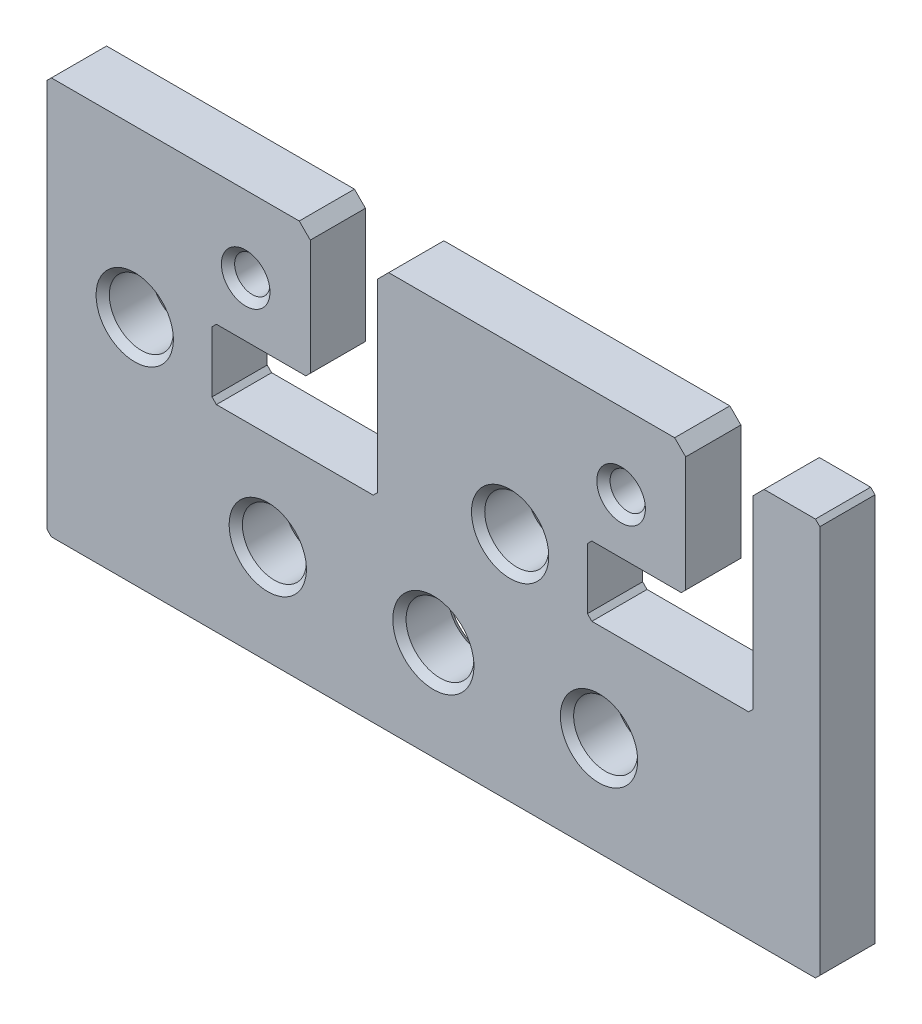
ISO-10303-21;
HEADER;
FILE_DESCRIPTION(('STEP AP214'),'2;1');
FILE_NAME('part.step','',(''),(''),'','','');
FILE_SCHEMA(('AUTOMOTIVE_DESIGN { 1 0 10303 214 1 1 1 1 }'));
ENDSEC;
DATA;
#1=APPLICATION_CONTEXT('core data for automotive mechanical design processes');
#2=APPLICATION_PROTOCOL_DEFINITION('international standard','automotive_design',2000,#1);
#3=PRODUCT_CONTEXT('',#1,'mechanical');
#4=PRODUCT('Part','Part','',(#3));
#5=PRODUCT_RELATED_PRODUCT_CATEGORY('part','',(#4));
#6=PRODUCT_DEFINITION_FORMATION('','',#4);
#7=PRODUCT_DEFINITION_CONTEXT('part definition',#1,'design');
#8=PRODUCT_DEFINITION('design','',#6,#7);
#9=PRODUCT_DEFINITION_SHAPE('','',#8);
#10=(LENGTH_UNIT() NAMED_UNIT(*) SI_UNIT(.MILLI.,.METRE.));
#11=(NAMED_UNIT(*) PLANE_ANGLE_UNIT() SI_UNIT($,.RADIAN.));
#12=(NAMED_UNIT(*) SI_UNIT($,.STERADIAN.) SOLID_ANGLE_UNIT());
#13=UNCERTAINTY_MEASURE_WITH_UNIT(LENGTH_MEASURE(1.E-05),#10,'distance_accuracy_value','');
#14=(GEOMETRIC_REPRESENTATION_CONTEXT(3) GLOBAL_UNCERTAINTY_ASSIGNED_CONTEXT((#13)) GLOBAL_UNIT_ASSIGNED_CONTEXT((#10,
#11,#12)) REPRESENTATION_CONTEXT('',''));
#15=CARTESIAN_POINT('',(0.,0.,0.));
#16=DIRECTION('',(0.,0.,1.));
#17=DIRECTION('',(1.,0.,0.));
#18=AXIS2_PLACEMENT_3D('',#15,#16,#17);
#19=CARTESIAN_POINT('',(0.,0.,5.));
#20=DIRECTION('',(0.,0.,-1.));
#21=DIRECTION('',(-1.,0.,0.));
#22=AXIS2_PLACEMENT_3D('',#19,#20,#21);
#23=PLANE('',#22);
#24=CARTESIAN_POINT('',(3.90190111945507,26.4778232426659,5.));
#25=DIRECTION('',(0.,0.,-1.));
#26=DIRECTION('',(-1.,0.,0.));
#27=AXIS2_PLACEMENT_3D('',#24,#25,#26);
#28=CIRCLE('',#27,2.2);
#29=CARTESIAN_POINT('',(1.70190111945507,26.4778232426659,5.));
#30=VERTEX_POINT('',#29);
#31=EDGE_CURVE('E482',#30,#30,#28,.T.);
#32=ORIENTED_EDGE('',*,*,#31,.T.);
#33=EDGE_LOOP('',(#32));
#34=FACE_BOUND('',#33,.T.);
#35=CARTESIAN_POINT('',(27.8519011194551,18.3778232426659,5.));
#36=DIRECTION('',(0.,0.,-1.));
#37=DIRECTION('',(-1.,0.,0.));
#38=AXIS2_PLACEMENT_3D('',#35,#36,#37);
#39=CIRCLE('',#38,3.49999999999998);
#40=CARTESIAN_POINT('',(24.3519011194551,18.3778232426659,5.));
#41=VERTEX_POINT('',#40);
#42=EDGE_CURVE('E479',#41,#41,#39,.T.);
#43=ORIENTED_EDGE('',*,*,#42,.T.);
#44=EDGE_LOOP('',(#43));
#45=FACE_BOUND('',#44,.T.);
#46=CARTESIAN_POINT('',(-6.14809888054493,18.3778232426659,5.));
#47=DIRECTION('',(0.,0.,-1.));
#48=DIRECTION('',(-1.,0.,0.));
#49=AXIS2_PLACEMENT_3D('',#46,#47,#48);
#50=CIRCLE('',#49,3.50000000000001);
#51=CARTESIAN_POINT('',(-9.64809888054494,18.3778232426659,5.));
#52=VERTEX_POINT('',#51);
#53=EDGE_CURVE('E476',#52,#52,#50,.T.);
#54=ORIENTED_EDGE('',*,*,#53,.T.);
#55=EDGE_LOOP('',(#54));
#56=FACE_BOUND('',#55,.T.);
#57=CARTESIAN_POINT('',(5.90190111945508,6.3778232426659,5.));
#58=DIRECTION('',(0.,0.,-1.));
#59=DIRECTION('',(-1.,0.,0.));
#60=AXIS2_PLACEMENT_3D('',#57,#58,#59);
#61=CIRCLE('',#60,3.5);
#62=CARTESIAN_POINT('',(2.40190111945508,6.3778232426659,5.));
#63=VERTEX_POINT('',#62);
#64=EDGE_CURVE('E473',#63,#63,#61,.T.);
#65=ORIENTED_EDGE('',*,*,#64,.T.);
#66=EDGE_LOOP('',(#65));
#67=FACE_BOUND('',#66,.T.);
#68=CARTESIAN_POINT('',(35.9019011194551,6.3778232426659,5.));
#69=DIRECTION('',(0.,0.,-1.));
#70=DIRECTION('',(-1.,0.,0.));
#71=AXIS2_PLACEMENT_3D('',#68,#69,#70);
#72=CIRCLE('',#71,3.5);
#73=CARTESIAN_POINT('',(32.4019011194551,6.3778232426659,5.));
#74=VERTEX_POINT('',#73);
#75=EDGE_CURVE('E470',#74,#74,#72,.T.);
#76=ORIENTED_EDGE('',*,*,#75,.T.);
#77=EDGE_LOOP('',(#76));
#78=FACE_BOUND('',#77,.T.);
#79=CARTESIAN_POINT('',(20.9019011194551,6.3778232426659,5.));
#80=DIRECTION('',(0.,0.,-1.));
#81=DIRECTION('',(-1.,0.,0.));
#82=AXIS2_PLACEMENT_3D('',#79,#80,#81);
#83=CIRCLE('',#82,3.67499999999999);
#84=CARTESIAN_POINT('',(17.2269011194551,6.3778232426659,5.));
#85=VERTEX_POINT('',#84);
#86=EDGE_CURVE('E467',#85,#85,#83,.T.);
#87=ORIENTED_EDGE('',*,*,#86,.T.);
#88=EDGE_LOOP('',(#87));
#89=FACE_BOUND('',#88,.T.);
#90=CARTESIAN_POINT('',(37.9019011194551,26.4778232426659,5.));
#91=DIRECTION('',(0.,0.,-1.));
#92=DIRECTION('',(-1.,0.,0.));
#93=AXIS2_PLACEMENT_3D('',#90,#91,#92);
#94=CIRCLE('',#93,2.2);
#95=CARTESIAN_POINT('',(35.7019011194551,26.4778232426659,5.));
#96=VERTEX_POINT('',#95);
#97=EDGE_CURVE('E464',#96,#96,#94,.T.);
#98=ORIENTED_EDGE('',*,*,#97,.T.);
#99=EDGE_LOOP('',(#98));
#100=FACE_BOUND('',#99,.T.);
#101=DIRECTION('',(-1.,0.,0.));
#102=VECTOR('',#101,1.);
#103=CARTESIAN_POINT('',(49.8519011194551,33.3778232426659,5.));
#104=LINE('',#103,#102);
#105=CARTESIAN_POINT('',(55.5019011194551,33.3778232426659,5.));
#106=VERTEX_POINT('',#105);
#107=CARTESIAN_POINT('',(50.8519011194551,33.3778232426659,5.));
#108=VERTEX_POINT('',#107);
#109=EDGE_CURVE('E580',#106,#108,#104,.T.);
#110=ORIENTED_EDGE('',*,*,#109,.T.);
#111=DIRECTION('',(0.707106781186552,0.707106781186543,0.));
#112=VECTOR('',#111,1.);
#113=CARTESIAN_POINT('',(49.8519011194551,32.3778232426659,5.));
#114=LINE('',#113,#112);
#115=CARTESIAN_POINT('',(49.8519011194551,32.3778232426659,5.));
#116=VERTEX_POINT('',#115);
#117=EDGE_CURVE('E390',#108,#116,#114,.F.);
#118=ORIENTED_EDGE('',*,*,#117,.T.);
#119=DIRECTION('',(0.,-1.,0.));
#120=VECTOR('',#119,1.);
#121=CARTESIAN_POINT('',(49.8519011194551,15.2278232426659,5.));
#122=LINE('',#121,#120);
#123=CARTESIAN_POINT('',(49.8519011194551,15.6278232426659,5.));
#124=VERTEX_POINT('',#123);
#125=EDGE_CURVE('E583',#116,#124,#122,.T.);
#126=ORIENTED_EDGE('',*,*,#125,.T.);
#127=DIRECTION('',(0.707106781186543,0.707106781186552,0.));
#128=VECTOR('',#127,1.);
#129=CARTESIAN_POINT('',(17.1120389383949,-17.1120389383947,5.));
#130=LINE('',#129,#128);
#131=CARTESIAN_POINT('',(49.4519011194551,15.2278232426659,5.));
#132=VERTEX_POINT('',#131);
#133=EDGE_CURVE('E438',#124,#132,#130,.F.);
#134=ORIENTED_EDGE('',*,*,#133,.T.);
#135=DIRECTION('',(-1.,0.,0.));
#136=VECTOR('',#135,1.);
#137=CARTESIAN_POINT('',(34.8519011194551,15.2278232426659,5.));
#138=LINE('',#137,#136);
#139=CARTESIAN_POINT('',(35.2519011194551,15.2278232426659,5.));
#140=VERTEX_POINT('',#139);
#141=EDGE_CURVE('E586',#132,#140,#138,.T.);
#142=ORIENTED_EDGE('',*,*,#141,.T.);
#143=DIRECTION('',(0.707106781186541,-0.707106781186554,0.));
#144=VECTOR('',#143,1.);
#145=CARTESIAN_POINT('',(25.2398621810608,25.2398621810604,5.));
#146=LINE('',#145,#144);
#147=CARTESIAN_POINT('',(34.8519011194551,15.6278232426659,5.));
#148=VERTEX_POINT('',#147);
#149=EDGE_CURVE('E446',#140,#148,#146,.F.);
#150=ORIENTED_EDGE('',*,*,#149,.T.);
#151=DIRECTION('',(0.,1.,0.));
#152=VECTOR('',#151,1.);
#153=CARTESIAN_POINT('',(34.8519011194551,21.5278232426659,5.));
#154=LINE('',#153,#152);
#155=CARTESIAN_POINT('',(34.8519011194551,21.1278232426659,5.));
#156=VERTEX_POINT('',#155);
#157=EDGE_CURVE('E589',#148,#156,#154,.T.);
#158=ORIENTED_EDGE('',*,*,#157,.T.);
#159=DIRECTION('',(-0.707106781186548,-0.707106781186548,0.));
#160=VECTOR('',#159,1.);
#161=CARTESIAN_POINT('',(6.86203893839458,-6.86203893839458,5.));
#162=LINE('',#161,#160);
#163=CARTESIAN_POINT('',(35.2519011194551,21.5278232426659,5.));
#164=VERTEX_POINT('',#163);
#165=EDGE_CURVE('E450',#156,#164,#162,.F.);
#166=ORIENTED_EDGE('',*,*,#165,.T.);
#167=DIRECTION('',(1.,0.,0.));
#168=VECTOR('',#167,1.);
#169=CARTESIAN_POINT('',(43.7519011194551,21.5278232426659,5.));
#170=LINE('',#169,#168);
#171=CARTESIAN_POINT('',(43.3519011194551,21.5278232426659,5.));
#172=VERTEX_POINT('',#171);
#173=EDGE_CURVE('E592',#164,#172,#170,.T.);
#174=ORIENTED_EDGE('',*,*,#173,.T.);
#175=DIRECTION('',(-0.707106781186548,-0.707106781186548,0.));
#176=VECTOR('',#175,1.);
#177=CARTESIAN_POINT('',(43.7519011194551,21.9278232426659,5.));
#178=LINE('',#177,#176);
#179=CARTESIAN_POINT('',(43.7519011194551,21.9278232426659,5.));
#180=VERTEX_POINT('',#179);
#181=EDGE_CURVE('E338',#172,#180,#178,.F.);
#182=ORIENTED_EDGE('',*,*,#181,.T.);
#183=DIRECTION('',(0.,1.,0.));
#184=VECTOR('',#183,1.);
#185=CARTESIAN_POINT('',(43.7519011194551,33.3778232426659,5.));
#186=LINE('',#185,#184);
#187=CARTESIAN_POINT('',(43.7519011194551,32.3778232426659,5.));
#188=VERTEX_POINT('',#187);
#189=EDGE_CURVE('E594',#180,#188,#186,.T.);
#190=ORIENTED_EDGE('',*,*,#189,.T.);
#191=DIRECTION('',(0.707106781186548,-0.707106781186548,0.));
#192=VECTOR('',#191,1.);
#193=CARTESIAN_POINT('',(42.7519011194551,33.3778232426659,5.));
#194=LINE('',#193,#192);
#195=CARTESIAN_POINT('',(42.7519011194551,33.3778232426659,5.));
#196=VERTEX_POINT('',#195);
#197=EDGE_CURVE('E388',#188,#196,#194,.F.);
#198=ORIENTED_EDGE('',*,*,#197,.T.);
#199=DIRECTION('',(-1.,0.,0.));
#200=VECTOR('',#199,1.);
#201=CARTESIAN_POINT('',(15.8519011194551,33.3778232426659,5.));
#202=LINE('',#201,#200);
#203=CARTESIAN_POINT('',(16.8519011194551,33.3778232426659,5.));
#204=VERTEX_POINT('',#203);
#205=EDGE_CURVE('E597',#196,#204,#202,.T.);
#206=ORIENTED_EDGE('',*,*,#205,.T.);
#207=DIRECTION('',(0.707106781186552,0.707106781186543,0.));
#208=VECTOR('',#207,1.);
#209=CARTESIAN_POINT('',(15.8519011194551,32.3778232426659,5.));
#210=LINE('',#209,#208);
#211=CARTESIAN_POINT('',(15.8519011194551,32.3778232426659,5.));
#212=VERTEX_POINT('',#211);
#213=EDGE_CURVE('E386',#204,#212,#210,.F.);
#214=ORIENTED_EDGE('',*,*,#213,.T.);
#215=DIRECTION('',(0.,-1.,0.));
#216=VECTOR('',#215,1.);
#217=CARTESIAN_POINT('',(15.8519011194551,15.2278232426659,5.));
#218=LINE('',#217,#216);
#219=CARTESIAN_POINT('',(15.8519011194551,15.6278232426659,5.));
#220=VERTEX_POINT('',#219);
#221=EDGE_CURVE('E600',#212,#220,#218,.T.);
#222=ORIENTED_EDGE('',*,*,#221,.T.);
#223=DIRECTION('',(0.707106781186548,0.707106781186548,0.));
#224=VECTOR('',#223,1.);
#225=CARTESIAN_POINT('',(0.112038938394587,-0.112038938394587,5.));
#226=LINE('',#225,#224);
#227=CARTESIAN_POINT('',(15.4519011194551,15.2278232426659,5.));
#228=VERTEX_POINT('',#227);
#229=EDGE_CURVE('E442',#220,#228,#226,.F.);
#230=ORIENTED_EDGE('',*,*,#229,.T.);
#231=DIRECTION('',(-1.,0.,0.));
#232=VECTOR('',#231,1.);
#233=CARTESIAN_POINT('',(0.851901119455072,15.2278232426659,5.));
#234=LINE('',#233,#232);
#235=CARTESIAN_POINT('',(1.25190111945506,15.2278232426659,5.));
#236=VERTEX_POINT('',#235);
#237=EDGE_CURVE('E603',#228,#236,#234,.T.);
#238=ORIENTED_EDGE('',*,*,#237,.T.);
#239=DIRECTION('',(0.707106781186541,-0.707106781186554,0.));
#240=VECTOR('',#239,1.);
#241=CARTESIAN_POINT('',(8.23986218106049,8.23986218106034,5.));
#242=LINE('',#241,#240);
#243=CARTESIAN_POINT('',(0.851901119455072,15.6278232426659,5.));
#244=VERTEX_POINT('',#243);
#245=EDGE_CURVE('E454',#236,#244,#242,.F.);
#246=ORIENTED_EDGE('',*,*,#245,.T.);
#247=DIRECTION('',(0.,1.,0.));
#248=VECTOR('',#247,1.);
#249=CARTESIAN_POINT('',(0.851901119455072,21.5278232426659,5.));
#250=LINE('',#249,#248);
#251=CARTESIAN_POINT('',(0.851901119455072,21.1278232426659,5.));
#252=VERTEX_POINT('',#251);
#253=EDGE_CURVE('E606',#244,#252,#250,.T.);
#254=ORIENTED_EDGE('',*,*,#253,.T.);
#255=DIRECTION('',(-0.707106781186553,-0.707106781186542,0.));
#256=VECTOR('',#255,1.);
#257=CARTESIAN_POINT('',(-10.1379610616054,10.1379610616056,5.));
#258=LINE('',#257,#256);
#259=CARTESIAN_POINT('',(1.25190111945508,21.5278232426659,5.));
#260=VERTEX_POINT('',#259);
#261=EDGE_CURVE('E51',#252,#260,#258,.F.);
#262=ORIENTED_EDGE('',*,*,#261,.T.);
#263=DIRECTION('',(1.,0.,0.));
#264=VECTOR('',#263,1.);
#265=CARTESIAN_POINT('',(9.75190111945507,21.5278232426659,5.));
#266=LINE('',#265,#264);
#267=CARTESIAN_POINT('',(9.35190111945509,21.5278232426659,5.));
#268=VERTEX_POINT('',#267);
#269=EDGE_CURVE('E608',#260,#268,#266,.T.);
#270=ORIENTED_EDGE('',*,*,#269,.T.);
#271=DIRECTION('',(-0.707106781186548,-0.707106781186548,0.));
#272=VECTOR('',#271,1.);
#273=CARTESIAN_POINT('',(9.75190111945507,21.9278232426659,5.));
#274=LINE('',#273,#272);
#275=CARTESIAN_POINT('',(9.75190111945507,21.9278232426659,5.));
#276=VERTEX_POINT('',#275);
#277=EDGE_CURVE('E336',#268,#276,#274,.F.);
#278=ORIENTED_EDGE('',*,*,#277,.T.);
#279=DIRECTION('',(0.,1.,0.));
#280=VECTOR('',#279,1.);
#281=CARTESIAN_POINT('',(9.75190111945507,33.3778232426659,5.));
#282=LINE('',#281,#280);
#283=CARTESIAN_POINT('',(9.75190111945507,32.3778232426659,5.));
#284=VERTEX_POINT('',#283);
#285=EDGE_CURVE('E610',#276,#284,#282,.T.);
#286=ORIENTED_EDGE('',*,*,#285,.T.);
#287=DIRECTION('',(0.707106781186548,-0.707106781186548,0.));
#288=VECTOR('',#287,1.);
#289=CARTESIAN_POINT('',(8.75190111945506,33.3778232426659,5.));
#290=LINE('',#289,#288);
#291=CARTESIAN_POINT('',(8.75190111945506,33.3778232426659,5.));
#292=VERTEX_POINT('',#291);
#293=EDGE_CURVE('E384',#284,#292,#290,.F.);
#294=ORIENTED_EDGE('',*,*,#293,.T.);
#295=DIRECTION('',(-1.,0.,0.));
#296=VECTOR('',#295,1.);
#297=CARTESIAN_POINT('',(-14.0980988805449,33.3778232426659,5.));
#298=LINE('',#297,#296);
#299=CARTESIAN_POINT('',(-13.6980988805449,33.3778232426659,5.));
#300=VERTEX_POINT('',#299);
#301=EDGE_CURVE('E320',#292,#300,#298,.T.);
#302=ORIENTED_EDGE('',*,*,#301,.T.);
#303=DIRECTION('',(0.707106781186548,0.707106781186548,0.));
#304=VECTOR('',#303,1.);
#305=CARTESIAN_POINT('',(-14.0980988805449,32.9778232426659,5.));
#306=LINE('',#305,#304);
#307=CARTESIAN_POINT('',(-14.0980988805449,32.9778232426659,5.));
#308=VERTEX_POINT('',#307);
#309=EDGE_CURVE('E340',#300,#308,#306,.F.);
#310=ORIENTED_EDGE('',*,*,#309,.T.);
#311=DIRECTION('',(0.,-1.,0.));
#312=VECTOR('',#311,1.);
#313=CARTESIAN_POINT('',(-14.0980988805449,-2.6221767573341,5.));
#314=LINE('',#313,#312);
#315=CARTESIAN_POINT('',(-14.0980988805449,-2.2221767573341,5.));
#316=VERTEX_POINT('',#315);
#317=EDGE_CURVE('E319',#308,#316,#314,.T.);
#318=ORIENTED_EDGE('',*,*,#317,.T.);
#319=DIRECTION('',(-0.707106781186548,0.707106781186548,0.));
#320=VECTOR('',#319,1.);
#321=CARTESIAN_POINT('',(-13.6980988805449,-2.6221767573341,5.));
#322=LINE('',#321,#320);
#323=CARTESIAN_POINT('',(-13.6980988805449,-2.6221767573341,5.));
#324=VERTEX_POINT('',#323);
#325=EDGE_CURVE('E346',#316,#324,#322,.F.);
#326=ORIENTED_EDGE('',*,*,#325,.T.);
#327=DIRECTION('',(1.,0.,0.));
#328=VECTOR('',#327,1.);
#329=CARTESIAN_POINT('',(-14.0980988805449,-2.6221767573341,5.));
#330=LINE('',#329,#328);
#331=CARTESIAN_POINT('',(55.5019011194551,-2.6221767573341,5.));
#332=VERTEX_POINT('',#331);
#333=EDGE_CURVE('E267',#324,#332,#330,.T.);
#334=ORIENTED_EDGE('',*,*,#333,.T.);
#335=DIRECTION('',(-0.70710678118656,-0.707106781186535,0.));
#336=VECTOR('',#335,1.);
#337=CARTESIAN_POINT('',(55.9019011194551,-2.2221767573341,5.));
#338=LINE('',#337,#336);
#339=CARTESIAN_POINT('',(55.9019011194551,-2.2221767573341,5.));
#340=VERTEX_POINT('',#339);
#341=EDGE_CURVE('E344',#332,#340,#338,.F.);
#342=ORIENTED_EDGE('',*,*,#341,.T.);
#343=DIRECTION('',(0.,1.,0.));
#344=VECTOR('',#343,1.);
#345=CARTESIAN_POINT('',(55.9019011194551,-2.6221767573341,5.));
#346=LINE('',#345,#344);
#347=CARTESIAN_POINT('',(55.9019011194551,32.9778232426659,5.));
#348=VERTEX_POINT('',#347);
#349=EDGE_CURVE('E577',#340,#348,#346,.T.);
#350=ORIENTED_EDGE('',*,*,#349,.T.);
#351=DIRECTION('',(0.707106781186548,-0.707106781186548,0.));
#352=VECTOR('',#351,1.);
#353=CARTESIAN_POINT('',(55.5019011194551,33.3778232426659,5.));
#354=LINE('',#353,#352);
#355=EDGE_CURVE('E342',#348,#106,#354,.F.);
#356=ORIENTED_EDGE('',*,*,#355,.T.);
#357=EDGE_LOOP('',(#110,#118,#126,#134,#142,#150,#158,#166,#174,#182,#190,#198,#206,#214,#222,
#230,#238,#246,#254,#262,#270,#278,#286,#294,#302,#310,#318,#326,#334,#342,#350,#356));
#358=FACE_BOUND('',#357,.T.);
#359=ADVANCED_FACE('F35',(#34,#45,#56,#67,#78,#89,#100,#358),#23,.F.);
#360=CARTESIAN_POINT('',(0.,0.,0.));
#361=DIRECTION('',(0.,0.,-1.));
#362=DIRECTION('',(-1.,0.,0.));
#363=AXIS2_PLACEMENT_3D('',#360,#361,#362);
#364=PLANE('',#363);
#365=CARTESIAN_POINT('',(27.8519011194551,18.3778232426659,0.));
#366=DIRECTION('',(0.,0.,-1.));
#367=DIRECTION('',(-1.,0.,0.));
#368=AXIS2_PLACEMENT_3D('',#365,#366,#367);
#369=CIRCLE('',#368,3.49999999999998);
#370=CARTESIAN_POINT('',(24.3519011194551,18.3778232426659,0.));
#371=VERTEX_POINT('',#370);
#372=EDGE_CURVE('E503',#371,#371,#369,.F.);
#373=ORIENTED_EDGE('',*,*,#372,.T.);
#374=EDGE_LOOP('',(#373));
#375=FACE_BOUND('',#374,.T.);
#376=CARTESIAN_POINT('',(-6.14809888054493,18.3778232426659,0.));
#377=DIRECTION('',(0.,0.,-1.));
#378=DIRECTION('',(-1.,0.,0.));
#379=AXIS2_PLACEMENT_3D('',#376,#377,#378);
#380=CIRCLE('',#379,3.5);
#381=CARTESIAN_POINT('',(-9.64809888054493,18.3778232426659,0.));
#382=VERTEX_POINT('',#381);
#383=EDGE_CURVE('E500',#382,#382,#380,.F.);
#384=ORIENTED_EDGE('',*,*,#383,.T.);
#385=EDGE_LOOP('',(#384));
#386=FACE_BOUND('',#385,.T.);
#387=CARTESIAN_POINT('',(3.90190111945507,26.4778232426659,0.));
#388=DIRECTION('',(0.,0.,-1.));
#389=DIRECTION('',(-1.,0.,0.));
#390=AXIS2_PLACEMENT_3D('',#387,#388,#389);
#391=CIRCLE('',#390,2.2);
#392=CARTESIAN_POINT('',(1.70190111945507,26.4778232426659,0.));
#393=VERTEX_POINT('',#392);
#394=EDGE_CURVE('E497',#393,#393,#391,.F.);
#395=ORIENTED_EDGE('',*,*,#394,.T.);
#396=EDGE_LOOP('',(#395));
#397=FACE_BOUND('',#396,.T.);
#398=CARTESIAN_POINT('',(37.9019011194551,26.4778232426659,0.));
#399=DIRECTION('',(0.,0.,-1.));
#400=DIRECTION('',(-1.,0.,0.));
#401=AXIS2_PLACEMENT_3D('',#398,#399,#400);
#402=CIRCLE('',#401,2.20000000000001);
#403=CARTESIAN_POINT('',(35.7019011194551,26.4778232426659,0.));
#404=VERTEX_POINT('',#403);
#405=EDGE_CURVE('E494',#404,#404,#402,.F.);
#406=ORIENTED_EDGE('',*,*,#405,.T.);
#407=EDGE_LOOP('',(#406));
#408=FACE_BOUND('',#407,.T.);
#409=CARTESIAN_POINT('',(5.90190111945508,6.3778232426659,0.));
#410=DIRECTION('',(0.,0.,-1.));
#411=DIRECTION('',(-1.,0.,0.));
#412=AXIS2_PLACEMENT_3D('',#409,#410,#411);
#413=CIRCLE('',#412,3.5);
#414=CARTESIAN_POINT('',(2.40190111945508,6.3778232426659,0.));
#415=VERTEX_POINT('',#414);
#416=EDGE_CURVE('E491',#415,#415,#413,.F.);
#417=ORIENTED_EDGE('',*,*,#416,.T.);
#418=EDGE_LOOP('',(#417));
#419=FACE_BOUND('',#418,.T.);
#420=CARTESIAN_POINT('',(20.9019011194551,6.3778232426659,0.));
#421=DIRECTION('',(0.,0.,-1.));
#422=DIRECTION('',(-1.,0.,0.));
#423=AXIS2_PLACEMENT_3D('',#420,#421,#422);
#424=CIRCLE('',#423,3.67499999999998);
#425=CARTESIAN_POINT('',(17.2269011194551,6.3778232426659,0.));
#426=VERTEX_POINT('',#425);
#427=EDGE_CURVE('E488',#426,#426,#424,.F.);
#428=ORIENTED_EDGE('',*,*,#427,.T.);
#429=EDGE_LOOP('',(#428));
#430=FACE_BOUND('',#429,.T.);
#431=CARTESIAN_POINT('',(35.9019011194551,6.3778232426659,0.));
#432=DIRECTION('',(0.,0.,-1.));
#433=DIRECTION('',(-1.,0.,0.));
#434=AXIS2_PLACEMENT_3D('',#431,#432,#433);
#435=CIRCLE('',#434,3.5);
#436=CARTESIAN_POINT('',(32.4019011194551,6.3778232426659,0.));
#437=VERTEX_POINT('',#436);
#438=EDGE_CURVE('E485',#437,#437,#435,.F.);
#439=ORIENTED_EDGE('',*,*,#438,.T.);
#440=EDGE_LOOP('',(#439));
#441=FACE_BOUND('',#440,.T.);
#442=DIRECTION('',(0.,-1.,0.));
#443=VECTOR('',#442,1.);
#444=CARTESIAN_POINT('',(49.8519011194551,15.2278232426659,0.));
#445=LINE('',#444,#443);
#446=CARTESIAN_POINT('',(49.8519011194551,32.3778232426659,0.));
#447=VERTEX_POINT('',#446);
#448=CARTESIAN_POINT('',(49.8519011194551,15.6278232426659,0.));
#449=VERTEX_POINT('',#448);
#450=EDGE_CURVE('E286',#447,#449,#445,.T.);
#451=ORIENTED_EDGE('',*,*,#450,.F.);
#452=DIRECTION('',(-0.707106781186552,-0.707106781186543,0.));
#453=VECTOR('',#452,1.);
#454=CARTESIAN_POINT('',(8.73703893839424,-8.73703893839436,0.));
#455=LINE('',#454,#453);
#456=CARTESIAN_POINT('',(50.8519011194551,33.3778232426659,0.));
#457=VERTEX_POINT('',#456);
#458=EDGE_CURVE('E380',#447,#457,#455,.F.);
#459=ORIENTED_EDGE('',*,*,#458,.T.);
#460=DIRECTION('',(-1.,0.,0.));
#461=VECTOR('',#460,1.);
#462=CARTESIAN_POINT('',(49.8519011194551,33.3778232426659,0.));
#463=LINE('',#462,#461);
#464=CARTESIAN_POINT('',(55.5019011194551,33.3778232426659,0.));
#465=VERTEX_POINT('',#464);
#466=EDGE_CURVE('E278',#465,#457,#463,.T.);
#467=ORIENTED_EDGE('',*,*,#466,.F.);
#468=DIRECTION('',(-0.707106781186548,0.707106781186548,0.));
#469=VECTOR('',#468,1.);
#470=CARTESIAN_POINT('',(44.4398621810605,44.4398621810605,0.));
#471=LINE('',#470,#469);
#472=CARTESIAN_POINT('',(55.9019011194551,32.9778232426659,0.));
#473=VERTEX_POINT('',#472);
#474=EDGE_CURVE('E330',#465,#473,#471,.F.);
#475=ORIENTED_EDGE('',*,*,#474,.T.);
#476=DIRECTION('',(0.,1.,0.));
#477=VECTOR('',#476,1.);
#478=CARTESIAN_POINT('',(55.9019011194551,-2.6221767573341,0.));
#479=LINE('',#478,#477);
#480=CARTESIAN_POINT('',(55.9019011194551,-2.2221767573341,0.));
#481=VERTEX_POINT('',#480);
#482=EDGE_CURVE('E274',#481,#473,#479,.T.);
#483=ORIENTED_EDGE('',*,*,#482,.F.);
#484=DIRECTION('',(0.70710678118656,0.707106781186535,0.));
#485=VECTOR('',#484,1.);
#486=CARTESIAN_POINT('',(29.0620389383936,-29.0620389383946,0.));
#487=LINE('',#486,#485);
#488=CARTESIAN_POINT('',(55.5019011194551,-2.6221767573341,0.));
#489=VERTEX_POINT('',#488);
#490=EDGE_CURVE('E258',#481,#489,#487,.F.);
#491=ORIENTED_EDGE('',*,*,#490,.T.);
#492=DIRECTION('',(1.,0.,0.));
#493=VECTOR('',#492,1.);
#494=CARTESIAN_POINT('',(-14.0980988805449,-2.6221767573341,0.));
#495=LINE('',#494,#493);
#496=CARTESIAN_POINT('',(-13.6980988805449,-2.6221767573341,0.));
#497=VERTEX_POINT('',#496);
#498=EDGE_CURVE('E264',#497,#489,#495,.T.);
#499=ORIENTED_EDGE('',*,*,#498,.F.);
#500=DIRECTION('',(0.707106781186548,-0.707106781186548,0.));
#501=VECTOR('',#500,1.);
#502=CARTESIAN_POINT('',(-8.16013781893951,-8.16013781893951,0.));
#503=LINE('',#502,#501);
#504=CARTESIAN_POINT('',(-14.0980988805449,-2.2221767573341,0.));
#505=VERTEX_POINT('',#504);
#506=EDGE_CURVE('E247',#497,#505,#503,.F.);
#507=ORIENTED_EDGE('',*,*,#506,.T.);
#508=DIRECTION('',(0.,-1.,0.));
#509=VECTOR('',#508,1.);
#510=CARTESIAN_POINT('',(-14.0980988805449,-2.6221767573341,0.));
#511=LINE('',#510,#509);
#512=CARTESIAN_POINT('',(-14.0980988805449,32.9778232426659,0.));
#513=VERTEX_POINT('',#512);
#514=EDGE_CURVE('E275',#513,#505,#511,.T.);
#515=ORIENTED_EDGE('',*,*,#514,.F.);
#516=DIRECTION('',(-0.707106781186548,-0.707106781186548,0.));
#517=VECTOR('',#516,1.);
#518=CARTESIAN_POINT('',(-23.5379610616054,23.5379610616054,0.));
#519=LINE('',#518,#517);
#520=CARTESIAN_POINT('',(-13.6980988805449,33.3778232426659,0.));
#521=VERTEX_POINT('',#520);
#522=EDGE_CURVE('E327',#513,#521,#519,.F.);
#523=ORIENTED_EDGE('',*,*,#522,.T.);
#524=DIRECTION('',(-1.,0.,0.));
#525=VECTOR('',#524,1.);
#526=CARTESIAN_POINT('',(-14.0980988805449,33.3778232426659,0.));
#527=LINE('',#526,#525);
#528=CARTESIAN_POINT('',(8.75190111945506,33.3778232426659,0.));
#529=VERTEX_POINT('',#528);
#530=EDGE_CURVE('E317',#529,#521,#527,.T.);
#531=ORIENTED_EDGE('',*,*,#530,.F.);
#532=DIRECTION('',(-0.707106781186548,0.707106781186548,0.));
#533=VECTOR('',#532,1.);
#534=CARTESIAN_POINT('',(21.0648621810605,21.0648621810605,0.));
#535=LINE('',#534,#533);
#536=CARTESIAN_POINT('',(9.75190111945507,32.3778232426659,0.));
#537=VERTEX_POINT('',#536);
#538=EDGE_CURVE('E374',#529,#537,#535,.F.);
#539=ORIENTED_EDGE('',*,*,#538,.T.);
#540=DIRECTION('',(0.,1.,0.));
#541=VECTOR('',#540,1.);
#542=CARTESIAN_POINT('',(9.75190111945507,33.3778232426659,0.));
#543=LINE('',#542,#541);
#544=CARTESIAN_POINT('',(9.75190111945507,21.9278232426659,0.));
#545=VERTEX_POINT('',#544);
#546=EDGE_CURVE('E314',#545,#537,#543,.T.);
#547=ORIENTED_EDGE('',*,*,#546,.F.);
#548=DIRECTION('',(0.707106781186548,0.707106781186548,0.));
#549=VECTOR('',#548,1.);
#550=CARTESIAN_POINT('',(-6.0879610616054,6.0879610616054,0.));
#551=LINE('',#550,#549);
#552=CARTESIAN_POINT('',(9.35190111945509,21.5278232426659,0.));
#553=VERTEX_POINT('',#552);
#554=EDGE_CURVE('E268',#545,#553,#551,.F.);
#555=ORIENTED_EDGE('',*,*,#554,.T.);
#556=DIRECTION('',(1.,0.,0.));
#557=VECTOR('',#556,1.);
#558=CARTESIAN_POINT('',(9.75190111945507,21.5278232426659,0.));
#559=LINE('',#558,#557);
#560=CARTESIAN_POINT('',(1.25190111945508,21.5278232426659,0.));
#561=VERTEX_POINT('',#560);
#562=EDGE_CURVE('E312',#561,#553,#559,.T.);
#563=ORIENTED_EDGE('',*,*,#562,.F.);
#564=DIRECTION('',(0.707106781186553,0.707106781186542,0.));
#565=VECTOR('',#564,1.);
#566=CARTESIAN_POINT('',(1.25190111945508,21.5278232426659,0.));
#567=LINE('',#566,#565);
#568=CARTESIAN_POINT('',(0.851901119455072,21.1278232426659,0.));
#569=VERTEX_POINT('',#568);
#570=EDGE_CURVE('E59',#561,#569,#567,.F.);
#571=ORIENTED_EDGE('',*,*,#570,.T.);
#572=DIRECTION('',(0.,1.,0.));
#573=VECTOR('',#572,1.);
#574=CARTESIAN_POINT('',(0.851901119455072,21.5278232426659,0.));
#575=LINE('',#574,#573);
#576=CARTESIAN_POINT('',(0.851901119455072,15.6278232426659,0.));
#577=VERTEX_POINT('',#576);
#578=EDGE_CURVE('E309',#577,#569,#575,.T.);
#579=ORIENTED_EDGE('',*,*,#578,.F.);
#580=DIRECTION('',(-0.707106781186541,0.707106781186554,0.));
#581=VECTOR('',#580,1.);
#582=CARTESIAN_POINT('',(0.851901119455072,15.6278232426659,0.));
#583=LINE('',#582,#581);
#584=CARTESIAN_POINT('',(1.25190111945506,15.2278232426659,0.));
#585=VERTEX_POINT('',#584);
#586=EDGE_CURVE('E452',#577,#585,#583,.F.);
#587=ORIENTED_EDGE('',*,*,#586,.T.);
#588=DIRECTION('',(-1.,0.,0.));
#589=VECTOR('',#588,1.);
#590=CARTESIAN_POINT('',(0.851901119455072,15.2278232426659,0.));
#591=LINE('',#590,#589);
#592=CARTESIAN_POINT('',(15.4519011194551,15.2278232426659,0.));
#593=VERTEX_POINT('',#592);
#594=EDGE_CURVE('E306',#593,#585,#591,.T.);
#595=ORIENTED_EDGE('',*,*,#594,.F.);
#596=DIRECTION('',(-0.707106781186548,-0.707106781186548,0.));
#597=VECTOR('',#596,1.);
#598=CARTESIAN_POINT('',(15.4519011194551,15.2278232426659,0.));
#599=LINE('',#598,#597);
#600=CARTESIAN_POINT('',(15.8519011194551,15.6278232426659,0.));
#601=VERTEX_POINT('',#600);
#602=EDGE_CURVE('E440',#593,#601,#599,.F.);
#603=ORIENTED_EDGE('',*,*,#602,.T.);
#604=DIRECTION('',(0.,-1.,0.));
#605=VECTOR('',#604,1.);
#606=CARTESIAN_POINT('',(15.8519011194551,15.2278232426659,0.));
#607=LINE('',#606,#605);
#608=CARTESIAN_POINT('',(15.8519011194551,32.3778232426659,0.));
#609=VERTEX_POINT('',#608);
#610=EDGE_CURVE('E303',#609,#601,#607,.T.);
#611=ORIENTED_EDGE('',*,*,#610,.F.);
#612=DIRECTION('',(-0.707106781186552,-0.707106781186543,0.));
#613=VECTOR('',#612,1.);
#614=CARTESIAN_POINT('',(-8.26296106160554,8.26296106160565,0.));
#615=LINE('',#614,#613);
#616=CARTESIAN_POINT('',(16.8519011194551,33.3778232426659,0.));
#617=VERTEX_POINT('',#616);
#618=EDGE_CURVE('E376',#609,#617,#615,.F.);
#619=ORIENTED_EDGE('',*,*,#618,.T.);
#620=DIRECTION('',(-1.,0.,0.));
#621=VECTOR('',#620,1.);
#622=CARTESIAN_POINT('',(15.8519011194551,33.3778232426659,0.));
#623=LINE('',#622,#621);
#624=CARTESIAN_POINT('',(42.7519011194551,33.3778232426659,0.));
#625=VERTEX_POINT('',#624);
#626=EDGE_CURVE('E300',#625,#617,#623,.T.);
#627=ORIENTED_EDGE('',*,*,#626,.F.);
#628=DIRECTION('',(-0.707106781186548,0.707106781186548,0.));
#629=VECTOR('',#628,1.);
#630=CARTESIAN_POINT('',(38.0648621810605,38.0648621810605,0.));
#631=LINE('',#630,#629);
#632=CARTESIAN_POINT('',(43.7519011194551,32.3778232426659,0.));
#633=VERTEX_POINT('',#632);
#634=EDGE_CURVE('E378',#625,#633,#631,.F.);
#635=ORIENTED_EDGE('',*,*,#634,.T.);
#636=DIRECTION('',(0.,1.,0.));
#637=VECTOR('',#636,1.);
#638=CARTESIAN_POINT('',(43.7519011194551,33.3778232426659,0.));
#639=LINE('',#638,#637);
#640=CARTESIAN_POINT('',(43.7519011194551,21.9278232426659,0.));
#641=VERTEX_POINT('',#640);
#642=EDGE_CURVE('E297',#641,#633,#639,.T.);
#643=ORIENTED_EDGE('',*,*,#642,.F.);
#644=DIRECTION('',(0.707106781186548,0.707106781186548,0.));
#645=VECTOR('',#644,1.);
#646=CARTESIAN_POINT('',(10.9120389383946,-10.9120389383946,0.));
#647=LINE('',#646,#645);
#648=CARTESIAN_POINT('',(43.3519011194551,21.5278232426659,0.));
#649=VERTEX_POINT('',#648);
#650=EDGE_CURVE('E324',#641,#649,#647,.F.);
#651=ORIENTED_EDGE('',*,*,#650,.T.);
#652=DIRECTION('',(1.,0.,0.));
#653=VECTOR('',#652,1.);
#654=CARTESIAN_POINT('',(43.7519011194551,21.5278232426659,0.));
#655=LINE('',#654,#653);
#656=CARTESIAN_POINT('',(35.2519011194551,21.5278232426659,0.));
#657=VERTEX_POINT('',#656);
#658=EDGE_CURVE('E295',#657,#649,#655,.T.);
#659=ORIENTED_EDGE('',*,*,#658,.F.);
#660=DIRECTION('',(0.707106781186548,0.707106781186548,0.));
#661=VECTOR('',#660,1.);
#662=CARTESIAN_POINT('',(35.2519011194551,21.5278232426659,0.));
#663=LINE('',#662,#661);
#664=CARTESIAN_POINT('',(34.8519011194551,21.1278232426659,0.));
#665=VERTEX_POINT('',#664);
#666=EDGE_CURVE('E448',#657,#665,#663,.F.);
#667=ORIENTED_EDGE('',*,*,#666,.T.);
#668=DIRECTION('',(0.,1.,0.));
#669=VECTOR('',#668,1.);
#670=CARTESIAN_POINT('',(34.8519011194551,21.5278232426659,0.));
#671=LINE('',#670,#669);
#672=CARTESIAN_POINT('',(34.8519011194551,15.6278232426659,0.));
#673=VERTEX_POINT('',#672);
#674=EDGE_CURVE('E292',#673,#665,#671,.T.);
#675=ORIENTED_EDGE('',*,*,#674,.F.);
#676=DIRECTION('',(-0.707106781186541,0.707106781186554,0.));
#677=VECTOR('',#676,1.);
#678=CARTESIAN_POINT('',(34.8519011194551,15.6278232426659,0.));
#679=LINE('',#678,#677);
#680=CARTESIAN_POINT('',(35.2519011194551,15.2278232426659,0.));
#681=VERTEX_POINT('',#680);
#682=EDGE_CURVE('E444',#673,#681,#679,.F.);
#683=ORIENTED_EDGE('',*,*,#682,.T.);
#684=DIRECTION('',(-1.,0.,0.));
#685=VECTOR('',#684,1.);
#686=CARTESIAN_POINT('',(34.8519011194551,15.2278232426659,0.));
#687=LINE('',#686,#685);
#688=CARTESIAN_POINT('',(49.4519011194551,15.2278232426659,0.));
#689=VERTEX_POINT('',#688);
#690=EDGE_CURVE('E289',#689,#681,#687,.T.);
#691=ORIENTED_EDGE('',*,*,#690,.F.);
#692=DIRECTION('',(-0.707106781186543,-0.707106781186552,0.));
#693=VECTOR('',#692,1.);
#694=CARTESIAN_POINT('',(49.4519011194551,15.2278232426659,0.));
#695=LINE('',#694,#693);
#696=EDGE_CURVE('E436',#689,#449,#695,.F.);
#697=ORIENTED_EDGE('',*,*,#696,.T.);
#698=EDGE_LOOP('',(#451,#459,#467,#475,#483,#491,#499,#507,#515,#523,#531,#539,#547,#555,#563,
#571,#579,#587,#595,#603,#611,#619,#627,#635,#643,#651,#659,#667,#675,#683,#691,#697));
#699=FACE_BOUND('',#698,.T.);
#700=ADVANCED_FACE('F272',(#375,#386,#397,#408,#419,#430,#441,#699),#364,.T.);
#701=CARTESIAN_POINT('',(-14.0980988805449,-2.6221767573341,5.));
#702=DIRECTION('',(1.,0.,0.));
#703=DIRECTION('',(0.,0.,-1.));
#704=AXIS2_PLACEMENT_3D('',#701,#702,#703);
#705=PLANE('',#704);
#706=ORIENTED_EDGE('',*,*,#514,.T.);
#707=DIRECTION('',(0.,0.,1.));
#708=VECTOR('',#707,1.);
#709=CARTESIAN_POINT('',(-14.0980988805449,-2.2221767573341,5.));
#710=LINE('',#709,#708);
#711=EDGE_CURVE('E252',#505,#316,#710,.T.);
#712=ORIENTED_EDGE('',*,*,#711,.T.);
#713=ORIENTED_EDGE('',*,*,#317,.F.);
#714=DIRECTION('',(0.,0.,-1.));
#715=VECTOR('',#714,1.);
#716=CARTESIAN_POINT('',(-14.0980988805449,32.9778232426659,5.));
#717=LINE('',#716,#715);
#718=EDGE_CURVE('E257',#308,#513,#717,.T.);
#719=ORIENTED_EDGE('',*,*,#718,.T.);
#720=EDGE_LOOP('',(#706,#712,#713,#719));
#721=FACE_BOUND('',#720,.T.);
#722=ADVANCED_FACE('F625',(#721),#705,.F.);
#723=CARTESIAN_POINT('',(-14.0980988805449,-2.6221767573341,5.));
#724=DIRECTION('',(0.,1.,0.));
#725=DIRECTION('',(0.,0.,1.));
#726=AXIS2_PLACEMENT_3D('',#723,#724,#725);
#727=PLANE('',#726);
#728=CARTESIAN_POINT('',(43.5019011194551,-2.6221767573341,2.5));
#729=DIRECTION('',(0.,1.,0.));
#730=DIRECTION('',(0.,0.,1.));
#731=AXIS2_PLACEMENT_3D('',#728,#729,#730);
#732=CIRCLE('',#731,2.);
#733=CARTESIAN_POINT('',(43.5019011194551,-2.6221767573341,4.5));
#734=VERTEX_POINT('',#733);
#735=EDGE_CURVE('E44',#734,#734,#732,.T.);
#736=ORIENTED_EDGE('',*,*,#735,.T.);
#737=EDGE_LOOP('',(#736));
#738=FACE_BOUND('',#737,.T.);
#739=CARTESIAN_POINT('',(-1.69809888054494,-2.6221767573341,2.5));
#740=DIRECTION('',(0.,1.,0.));
#741=DIRECTION('',(0.,0.,1.));
#742=AXIS2_PLACEMENT_3D('',#739,#740,#741);
#743=CIRCLE('',#742,2.);
#744=CARTESIAN_POINT('',(-1.69809888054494,-2.6221767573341,4.5));
#745=VERTEX_POINT('',#744);
#746=EDGE_CURVE('E545',#745,#745,#743,.T.);
#747=ORIENTED_EDGE('',*,*,#746,.T.);
#748=EDGE_LOOP('',(#747));
#749=FACE_BOUND('',#748,.T.);
#750=ORIENTED_EDGE('',*,*,#333,.F.);
#751=DIRECTION('',(0.,0.,-1.));
#752=VECTOR('',#751,1.);
#753=CARTESIAN_POINT('',(-13.6980988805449,-2.6221767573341,5.));
#754=LINE('',#753,#752);
#755=EDGE_CURVE('E251',#324,#497,#754,.T.);
#756=ORIENTED_EDGE('',*,*,#755,.T.);
#757=ORIENTED_EDGE('',*,*,#498,.T.);
#758=DIRECTION('',(0.,0.,1.));
#759=VECTOR('',#758,1.);
#760=CARTESIAN_POINT('',(55.5019011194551,-2.6221767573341,5.));
#761=LINE('',#760,#759);
#762=EDGE_CURVE('E269',#489,#332,#761,.T.);
#763=ORIENTED_EDGE('',*,*,#762,.T.);
#764=EDGE_LOOP('',(#750,#756,#757,#763));
#765=FACE_BOUND('',#764,.T.);
#766=ADVANCED_FACE('F263',(#738,#749,#765),#727,.F.);
#767=CARTESIAN_POINT('',(55.9019011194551,-2.6221767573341,5.));
#768=DIRECTION('',(-1.,0.,0.));
#769=DIRECTION('',(0.,0.,1.));
#770=AXIS2_PLACEMENT_3D('',#767,#768,#769);
#771=PLANE('',#770);
#772=ORIENTED_EDGE('',*,*,#349,.F.);
#773=DIRECTION('',(0.,0.,-1.));
#774=VECTOR('',#773,1.);
#775=CARTESIAN_POINT('',(55.9019011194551,-2.2221767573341,5.));
#776=LINE('',#775,#774);
#777=EDGE_CURVE('E350',#340,#481,#776,.T.);
#778=ORIENTED_EDGE('',*,*,#777,.T.);
#779=ORIENTED_EDGE('',*,*,#482,.T.);
#780=DIRECTION('',(0.,0.,1.));
#781=VECTOR('',#780,1.);
#782=CARTESIAN_POINT('',(55.9019011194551,32.9778232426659,5.));
#783=LINE('',#782,#781);
#784=EDGE_CURVE('E348',#473,#348,#783,.T.);
#785=ORIENTED_EDGE('',*,*,#784,.T.);
#786=EDGE_LOOP('',(#772,#778,#779,#785));
#787=FACE_BOUND('',#786,.T.);
#788=ADVANCED_FACE('F709',(#787),#771,.F.);
#789=CARTESIAN_POINT('',(49.8519011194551,33.3778232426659,5.));
#790=DIRECTION('',(0.,-1.,0.));
#791=DIRECTION('',(0.,0.,-1.));
#792=AXIS2_PLACEMENT_3D('',#789,#790,#791);
#793=PLANE('',#792);
#794=ORIENTED_EDGE('',*,*,#466,.T.);
#795=DIRECTION('',(0.,0.,1.));
#796=VECTOR('',#795,1.);
#797=CARTESIAN_POINT('',(50.8519011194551,33.3778232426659,5.));
#798=LINE('',#797,#796);
#799=EDGE_CURVE('E382',#457,#108,#798,.T.);
#800=ORIENTED_EDGE('',*,*,#799,.T.);
#801=ORIENTED_EDGE('',*,*,#109,.F.);
#802=DIRECTION('',(0.,0.,-1.));
#803=VECTOR('',#802,1.);
#804=CARTESIAN_POINT('',(55.5019011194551,33.3778232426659,5.));
#805=LINE('',#804,#803);
#806=EDGE_CURVE('E353',#106,#465,#805,.T.);
#807=ORIENTED_EDGE('',*,*,#806,.T.);
#808=EDGE_LOOP('',(#794,#800,#801,#807));
#809=FACE_BOUND('',#808,.T.);
#810=ADVANCED_FACE('F705',(#809),#793,.F.);
#811=CARTESIAN_POINT('',(49.8519011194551,15.2278232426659,5.));
#812=DIRECTION('',(1.,0.,0.));
#813=DIRECTION('',(0.,0.,-1.));
#814=AXIS2_PLACEMENT_3D('',#811,#812,#813);
#815=PLANE('',#814);
#816=ORIENTED_EDGE('',*,*,#450,.T.);
#817=DIRECTION('',(0.,0.,1.));
#818=VECTOR('',#817,1.);
#819=CARTESIAN_POINT('',(49.8519011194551,15.6278232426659,5.));
#820=LINE('',#819,#818);
#821=EDGE_CURVE('E412',#449,#124,#820,.T.);
#822=ORIENTED_EDGE('',*,*,#821,.T.);
#823=ORIENTED_EDGE('',*,*,#125,.F.);
#824=DIRECTION('',(0.,0.,-1.));
#825=VECTOR('',#824,1.);
#826=CARTESIAN_POINT('',(49.8519011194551,32.3778232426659,5.));
#827=LINE('',#826,#825);
#828=EDGE_CURVE('E371',#116,#447,#827,.T.);
#829=ORIENTED_EDGE('',*,*,#828,.T.);
#830=EDGE_LOOP('',(#816,#822,#823,#829));
#831=FACE_BOUND('',#830,.T.);
#832=ADVANCED_FACE('F701',(#831),#815,.F.);
#833=CARTESIAN_POINT('',(34.8519011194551,15.2278232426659,5.));
#834=DIRECTION('',(0.,-1.,0.));
#835=DIRECTION('',(1.,0.,0.));
#836=AXIS2_PLACEMENT_3D('',#833,#834,#835);
#837=PLANE('',#836);
#838=ORIENTED_EDGE('',*,*,#141,.F.);
#839=DIRECTION('',(0.,0.,-1.));
#840=VECTOR('',#839,1.);
#841=CARTESIAN_POINT('',(49.4519011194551,15.2278232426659,0.));
#842=LINE('',#841,#840);
#843=EDGE_CURVE('E409',#132,#689,#842,.T.);
#844=ORIENTED_EDGE('',*,*,#843,.T.);
#845=ORIENTED_EDGE('',*,*,#690,.T.);
#846=DIRECTION('',(0.,0.,1.));
#847=VECTOR('',#846,1.);
#848=CARTESIAN_POINT('',(35.2519011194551,15.2278232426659,5.));
#849=LINE('',#848,#847);
#850=EDGE_CURVE('E407',#681,#140,#849,.T.);
#851=ORIENTED_EDGE('',*,*,#850,.T.);
#852=EDGE_LOOP('',(#838,#844,#845,#851));
#853=FACE_BOUND('',#852,.T.);
#854=ADVANCED_FACE('F697',(#853),#837,.F.);
#855=CARTESIAN_POINT('',(34.8519011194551,21.5278232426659,5.));
#856=DIRECTION('',(-1.,0.,0.));
#857=DIRECTION('',(0.,0.,1.));
#858=AXIS2_PLACEMENT_3D('',#855,#856,#857);
#859=PLANE('',#858);
#860=ORIENTED_EDGE('',*,*,#157,.F.);
#861=DIRECTION('',(0.,0.,-1.));
#862=VECTOR('',#861,1.);
#863=CARTESIAN_POINT('',(34.8519011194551,15.6278232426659,0.));
#864=LINE('',#863,#862);
#865=EDGE_CURVE('E423',#148,#673,#864,.T.);
#866=ORIENTED_EDGE('',*,*,#865,.T.);
#867=ORIENTED_EDGE('',*,*,#674,.T.);
#868=DIRECTION('',(0.,0.,1.));
#869=VECTOR('',#868,1.);
#870=CARTESIAN_POINT('',(34.8519011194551,21.1278232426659,5.));
#871=LINE('',#870,#869);
#872=EDGE_CURVE('E421',#665,#156,#871,.T.);
#873=ORIENTED_EDGE('',*,*,#872,.T.);
#874=EDGE_LOOP('',(#860,#866,#867,#873));
#875=FACE_BOUND('',#874,.T.);
#876=ADVANCED_FACE('F693',(#875),#859,.F.);
#877=CARTESIAN_POINT('',(43.7519011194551,21.5278232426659,5.));
#878=DIRECTION('',(0.,1.,0.));
#879=DIRECTION('',(-1.,0.,0.));
#880=AXIS2_PLACEMENT_3D('',#877,#878,#879);
#881=PLANE('',#880);
#882=ORIENTED_EDGE('',*,*,#173,.F.);
#883=DIRECTION('',(0.,0.,-1.));
#884=VECTOR('',#883,1.);
#885=CARTESIAN_POINT('',(35.2519011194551,21.5278232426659,0.));
#886=LINE('',#885,#884);
#887=EDGE_CURVE('E426',#164,#657,#886,.T.);
#888=ORIENTED_EDGE('',*,*,#887,.T.);
#889=ORIENTED_EDGE('',*,*,#658,.T.);
#890=DIRECTION('',(0.,0.,1.));
#891=VECTOR('',#890,1.);
#892=CARTESIAN_POINT('',(43.3519011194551,21.5278232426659,5.));
#893=LINE('',#892,#891);
#894=EDGE_CURVE('E362',#649,#172,#893,.T.);
#895=ORIENTED_EDGE('',*,*,#894,.T.);
#896=EDGE_LOOP('',(#882,#888,#889,#895));
#897=FACE_BOUND('',#896,.T.);
#898=ADVANCED_FACE('F689',(#897),#881,.F.);
#899=CARTESIAN_POINT('',(43.7519011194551,33.3778232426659,5.));
#900=DIRECTION('',(-1.,0.,0.));
#901=DIRECTION('',(0.,-1.,0.));
#902=AXIS2_PLACEMENT_3D('',#899,#900,#901);
#903=PLANE('',#902);
#904=ORIENTED_EDGE('',*,*,#642,.T.);
#905=DIRECTION('',(0.,0.,1.));
#906=VECTOR('',#905,1.);
#907=CARTESIAN_POINT('',(43.7519011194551,32.3778232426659,5.));
#908=LINE('',#907,#906);
#909=EDGE_CURVE('E397',#633,#188,#908,.T.);
#910=ORIENTED_EDGE('',*,*,#909,.T.);
#911=ORIENTED_EDGE('',*,*,#189,.F.);
#912=DIRECTION('',(0.,0.,-1.));
#913=VECTOR('',#912,1.);
#914=CARTESIAN_POINT('',(43.7519011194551,21.9278232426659,5.));
#915=LINE('',#914,#913);
#916=EDGE_CURVE('E359',#180,#641,#915,.T.);
#917=ORIENTED_EDGE('',*,*,#916,.T.);
#918=EDGE_LOOP('',(#904,#910,#911,#917));
#919=FACE_BOUND('',#918,.T.);
#920=ADVANCED_FACE('F685',(#919),#903,.F.);
#921=CARTESIAN_POINT('',(15.8519011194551,33.3778232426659,5.));
#922=DIRECTION('',(0.,-1.,0.));
#923=DIRECTION('',(0.,0.,-1.));
#924=AXIS2_PLACEMENT_3D('',#921,#922,#923);
#925=PLANE('',#924);
#926=ORIENTED_EDGE('',*,*,#205,.F.);
#927=DIRECTION('',(0.,0.,-1.));
#928=VECTOR('',#927,1.);
#929=CARTESIAN_POINT('',(42.7519011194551,33.3778232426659,5.));
#930=LINE('',#929,#928);
#931=EDGE_CURVE('E394',#196,#625,#930,.T.);
#932=ORIENTED_EDGE('',*,*,#931,.T.);
#933=ORIENTED_EDGE('',*,*,#626,.T.);
#934=DIRECTION('',(0.,0.,1.));
#935=VECTOR('',#934,1.);
#936=CARTESIAN_POINT('',(16.8519011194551,33.3778232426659,5.));
#937=LINE('',#936,#935);
#938=EDGE_CURVE('E392',#617,#204,#937,.T.);
#939=ORIENTED_EDGE('',*,*,#938,.T.);
#940=EDGE_LOOP('',(#926,#932,#933,#939));
#941=FACE_BOUND('',#940,.T.);
#942=ADVANCED_FACE('F681',(#941),#925,.F.);
#943=CARTESIAN_POINT('',(15.8519011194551,15.2278232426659,5.));
#944=DIRECTION('',(1.,0.,0.));
#945=DIRECTION('',(0.,0.,-1.));
#946=AXIS2_PLACEMENT_3D('',#943,#944,#945);
#947=PLANE('',#946);
#948=ORIENTED_EDGE('',*,*,#610,.T.);
#949=DIRECTION('',(0.,0.,1.));
#950=VECTOR('',#949,1.);
#951=CARTESIAN_POINT('',(15.8519011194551,15.6278232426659,5.));
#952=LINE('',#951,#950);
#953=EDGE_CURVE('E419',#601,#220,#952,.T.);
#954=ORIENTED_EDGE('',*,*,#953,.T.);
#955=ORIENTED_EDGE('',*,*,#221,.F.);
#956=DIRECTION('',(0.,0.,-1.));
#957=VECTOR('',#956,1.);
#958=CARTESIAN_POINT('',(15.8519011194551,32.3778232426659,5.));
#959=LINE('',#958,#957);
#960=EDGE_CURVE('E399',#212,#609,#959,.T.);
#961=ORIENTED_EDGE('',*,*,#960,.T.);
#962=EDGE_LOOP('',(#948,#954,#955,#961));
#963=FACE_BOUND('',#962,.T.);
#964=ADVANCED_FACE('F677',(#963),#947,.F.);
#965=CARTESIAN_POINT('',(0.851901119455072,15.2278232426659,5.));
#966=DIRECTION('',(0.,-1.,0.));
#967=DIRECTION('',(0.,0.,-1.));
#968=AXIS2_PLACEMENT_3D('',#965,#966,#967);
#969=PLANE('',#968);
#970=ORIENTED_EDGE('',*,*,#237,.F.);
#971=DIRECTION('',(0.,0.,-1.));
#972=VECTOR('',#971,1.);
#973=CARTESIAN_POINT('',(15.4519011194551,15.2278232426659,0.));
#974=LINE('',#973,#972);
#975=EDGE_CURVE('E416',#228,#593,#974,.T.);
#976=ORIENTED_EDGE('',*,*,#975,.T.);
#977=ORIENTED_EDGE('',*,*,#594,.T.);
#978=DIRECTION('',(0.,0.,1.));
#979=VECTOR('',#978,1.);
#980=CARTESIAN_POINT('',(1.25190111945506,15.2278232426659,5.));
#981=LINE('',#980,#979);
#982=EDGE_CURVE('E414',#585,#236,#981,.T.);
#983=ORIENTED_EDGE('',*,*,#982,.T.);
#984=EDGE_LOOP('',(#970,#976,#977,#983));
#985=FACE_BOUND('',#984,.T.);
#986=ADVANCED_FACE('F673',(#985),#969,.F.);
#987=CARTESIAN_POINT('',(0.851901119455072,21.5278232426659,5.));
#988=DIRECTION('',(-1.,0.,0.));
#989=DIRECTION('',(0.,0.,1.));
#990=AXIS2_PLACEMENT_3D('',#987,#988,#989);
#991=PLANE('',#990);
#992=ORIENTED_EDGE('',*,*,#253,.F.);
#993=DIRECTION('',(0.,0.,-1.));
#994=VECTOR('',#993,1.);
#995=CARTESIAN_POINT('',(0.851901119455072,15.6278232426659,0.));
#996=LINE('',#995,#994);
#997=EDGE_CURVE('E431',#244,#577,#996,.T.);
#998=ORIENTED_EDGE('',*,*,#997,.T.);
#999=ORIENTED_EDGE('',*,*,#578,.T.);
#1000=DIRECTION('',(0.,0.,1.));
#1001=VECTOR('',#1000,1.);
#1002=CARTESIAN_POINT('',(0.851901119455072,21.1278232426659,5.));
#1003=LINE('',#1002,#1001);
#1004=EDGE_CURVE('E429',#569,#252,#1003,.T.);
#1005=ORIENTED_EDGE('',*,*,#1004,.T.);
#1006=EDGE_LOOP('',(#992,#998,#999,#1005));
#1007=FACE_BOUND('',#1006,.T.);
#1008=ADVANCED_FACE('F669',(#1007),#991,.F.);
#1009=CARTESIAN_POINT('',(9.75190111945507,21.5278232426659,5.));
#1010=DIRECTION('',(0.,1.,0.));
#1011=DIRECTION('',(0.,0.,1.));
#1012=AXIS2_PLACEMENT_3D('',#1009,#1010,#1011);
#1013=PLANE('',#1012);
#1014=ORIENTED_EDGE('',*,*,#269,.F.);
#1015=DIRECTION('',(0.,0.,-1.));
#1016=VECTOR('',#1015,1.);
#1017=CARTESIAN_POINT('',(1.25190111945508,21.5278232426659,0.));
#1018=LINE('',#1017,#1016);
#1019=EDGE_CURVE('E434',#260,#561,#1018,.T.);
#1020=ORIENTED_EDGE('',*,*,#1019,.T.);
#1021=ORIENTED_EDGE('',*,*,#562,.T.);
#1022=DIRECTION('',(0.,0.,1.));
#1023=VECTOR('',#1022,1.);
#1024=CARTESIAN_POINT('',(9.35190111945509,21.5278232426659,5.));
#1025=LINE('',#1024,#1023);
#1026=EDGE_CURVE('E368',#553,#268,#1025,.T.);
#1027=ORIENTED_EDGE('',*,*,#1026,.T.);
#1028=EDGE_LOOP('',(#1014,#1020,#1021,#1027));
#1029=FACE_BOUND('',#1028,.T.);
#1030=ADVANCED_FACE('F666',(#1029),#1013,.F.);
#1031=CARTESIAN_POINT('',(9.75190111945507,33.3778232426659,5.));
#1032=DIRECTION('',(-1.,0.,0.));
#1033=DIRECTION('',(0.,-1.,0.));
#1034=AXIS2_PLACEMENT_3D('',#1031,#1032,#1033);
#1035=PLANE('',#1034);
#1036=ORIENTED_EDGE('',*,*,#546,.T.);
#1037=DIRECTION('',(0.,0.,1.));
#1038=VECTOR('',#1037,1.);
#1039=CARTESIAN_POINT('',(9.75190111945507,32.3778232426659,5.));
#1040=LINE('',#1039,#1038);
#1041=EDGE_CURVE('E405',#537,#284,#1040,.T.);
#1042=ORIENTED_EDGE('',*,*,#1041,.T.);
#1043=ORIENTED_EDGE('',*,*,#285,.F.);
#1044=DIRECTION('',(0.,0.,-1.));
#1045=VECTOR('',#1044,1.);
#1046=CARTESIAN_POINT('',(9.75190111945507,21.9278232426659,5.));
#1047=LINE('',#1046,#1045);
#1048=EDGE_CURVE('E365',#276,#545,#1047,.T.);
#1049=ORIENTED_EDGE('',*,*,#1048,.T.);
#1050=EDGE_LOOP('',(#1036,#1042,#1043,#1049));
#1051=FACE_BOUND('',#1050,.T.);
#1052=ADVANCED_FACE('F630',(#1051),#1035,.F.);
#1053=CARTESIAN_POINT('',(-14.0980988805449,33.3778232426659,5.));
#1054=DIRECTION('',(0.,-1.,0.));
#1055=DIRECTION('',(0.,0.,-1.));
#1056=AXIS2_PLACEMENT_3D('',#1053,#1054,#1055);
#1057=PLANE('',#1056);
#1058=ORIENTED_EDGE('',*,*,#301,.F.);
#1059=DIRECTION('',(0.,0.,-1.));
#1060=VECTOR('',#1059,1.);
#1061=CARTESIAN_POINT('',(8.75190111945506,33.3778232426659,5.));
#1062=LINE('',#1061,#1060);
#1063=EDGE_CURVE('E402',#292,#529,#1062,.T.);
#1064=ORIENTED_EDGE('',*,*,#1063,.T.);
#1065=ORIENTED_EDGE('',*,*,#530,.T.);
#1066=DIRECTION('',(0.,0.,1.));
#1067=VECTOR('',#1066,1.);
#1068=CARTESIAN_POINT('',(-13.6980988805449,33.3778232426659,5.));
#1069=LINE('',#1068,#1067);
#1070=EDGE_CURVE('E356',#521,#300,#1069,.T.);
#1071=ORIENTED_EDGE('',*,*,#1070,.T.);
#1072=EDGE_LOOP('',(#1058,#1064,#1065,#1071));
#1073=FACE_BOUND('',#1072,.T.);
#1074=ADVANCED_FACE('F619',(#1073),#1057,.F.);
#1075=CARTESIAN_POINT('',(20.9019011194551,6.3778232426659,5.));
#1076=DIRECTION('',(0.,0.,-1.));
#1077=DIRECTION('',(-1.,0.,0.));
#1078=AXIS2_PLACEMENT_3D('',#1075,#1076,#1077);
#1079=CYLINDRICAL_SURFACE('',#1078,3.075);
#1080=CARTESIAN_POINT('',(20.9019011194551,6.3778232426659,0.59999999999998));
#1081=DIRECTION('',(0.,0.,-1.));
#1082=DIRECTION('',(-1.,0.,0.));
#1083=AXIS2_PLACEMENT_3D('',#1080,#1081,#1082);
#1084=CIRCLE('',#1083,3.075);
#1085=CARTESIAN_POINT('',(17.8269011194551,6.3778232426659,0.59999999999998));
#1086=VERTEX_POINT('',#1085);
#1087=EDGE_CURVE('E533',#1086,#1086,#1084,.T.);
#1088=ORIENTED_EDGE('',*,*,#1087,.T.);
#1089=EDGE_LOOP('',(#1088));
#1090=FACE_BOUND('',#1089,.T.);
#1091=CARTESIAN_POINT('',(20.9019011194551,6.3778232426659,4.40000000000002));
#1092=DIRECTION('',(0.,0.,-1.));
#1093=DIRECTION('',(-1.,0.,0.));
#1094=AXIS2_PLACEMENT_3D('',#1091,#1092,#1093);
#1095=CIRCLE('',#1094,3.075);
#1096=CARTESIAN_POINT('',(17.8269011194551,6.3778232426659,4.40000000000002));
#1097=VERTEX_POINT('',#1096);
#1098=EDGE_CURVE('E530',#1097,#1097,#1095,.F.);
#1099=ORIENTED_EDGE('',*,*,#1098,.T.);
#1100=EDGE_LOOP('',(#1099));
#1101=FACE_BOUND('',#1100,.T.);
#1102=ADVANCED_FACE('F659',(#1090,#1101),#1079,.F.);
#1103=CARTESIAN_POINT('',(35.9019011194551,6.3778232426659,5.));
#1104=DIRECTION('',(0.,0.,-1.));
#1105=DIRECTION('',(-1.,0.,0.));
#1106=AXIS2_PLACEMENT_3D('',#1103,#1104,#1105);
#1107=CYLINDRICAL_SURFACE('',#1106,2.9);
#1108=CARTESIAN_POINT('',(35.9019011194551,6.3778232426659,0.600000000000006));
#1109=DIRECTION('',(0.,0.,-1.));
#1110=DIRECTION('',(-1.,0.,0.));
#1111=AXIS2_PLACEMENT_3D('',#1108,#1109,#1110);
#1112=CIRCLE('',#1111,2.9);
#1113=CARTESIAN_POINT('',(33.0019011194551,6.3778232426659,0.600000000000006));
#1114=VERTEX_POINT('',#1113);
#1115=EDGE_CURVE('E539',#1114,#1114,#1112,.T.);
#1116=ORIENTED_EDGE('',*,*,#1115,.T.);
#1117=EDGE_LOOP('',(#1116));
#1118=FACE_BOUND('',#1117,.T.);
#1119=CARTESIAN_POINT('',(35.9019011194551,6.3778232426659,4.40000000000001));
#1120=DIRECTION('',(0.,0.,-1.));
#1121=DIRECTION('',(-1.,0.,0.));
#1122=AXIS2_PLACEMENT_3D('',#1119,#1120,#1121);
#1123=CIRCLE('',#1122,2.9);
#1124=CARTESIAN_POINT('',(33.0019011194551,6.3778232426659,4.40000000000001));
#1125=VERTEX_POINT('',#1124);
#1126=EDGE_CURVE('E536',#1125,#1125,#1123,.F.);
#1127=ORIENTED_EDGE('',*,*,#1126,.T.);
#1128=EDGE_LOOP('',(#1127));
#1129=FACE_BOUND('',#1128,.T.);
#1130=ADVANCED_FACE('F885',(#1118,#1129),#1107,.F.);
#1131=CARTESIAN_POINT('',(5.90190111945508,6.3778232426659,5.));
#1132=DIRECTION('',(0.,0.,-1.));
#1133=DIRECTION('',(-1.,0.,0.));
#1134=AXIS2_PLACEMENT_3D('',#1131,#1132,#1133);
#1135=CYLINDRICAL_SURFACE('',#1134,2.9);
#1136=CARTESIAN_POINT('',(5.90190111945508,6.3778232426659,0.600000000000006));
#1137=DIRECTION('',(0.,0.,-1.));
#1138=DIRECTION('',(-1.,0.,0.));
#1139=AXIS2_PLACEMENT_3D('',#1136,#1137,#1138);
#1140=CIRCLE('',#1139,2.9);
#1141=CARTESIAN_POINT('',(3.00190111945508,6.3778232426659,0.600000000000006));
#1142=VERTEX_POINT('',#1141);
#1143=EDGE_CURVE('E527',#1142,#1142,#1140,.T.);
#1144=ORIENTED_EDGE('',*,*,#1143,.T.);
#1145=EDGE_LOOP('',(#1144));
#1146=FACE_BOUND('',#1145,.T.);
#1147=CARTESIAN_POINT('',(5.90190111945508,6.3778232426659,4.40000000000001));
#1148=DIRECTION('',(0.,0.,-1.));
#1149=DIRECTION('',(-1.,0.,0.));
#1150=AXIS2_PLACEMENT_3D('',#1147,#1148,#1149);
#1151=CIRCLE('',#1150,2.9);
#1152=CARTESIAN_POINT('',(3.00190111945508,6.3778232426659,4.40000000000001));
#1153=VERTEX_POINT('',#1152);
#1154=EDGE_CURVE('E524',#1153,#1153,#1151,.F.);
#1155=ORIENTED_EDGE('',*,*,#1154,.T.);
#1156=EDGE_LOOP('',(#1155));
#1157=FACE_BOUND('',#1156,.T.);
#1158=ADVANCED_FACE('F890',(#1146,#1157),#1135,.F.);
#1159=CARTESIAN_POINT('',(3.90190111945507,26.4778232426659,5.));
#1160=DIRECTION('',(0.,0.,-1.));
#1161=DIRECTION('',(-1.,0.,0.));
#1162=AXIS2_PLACEMENT_3D('',#1159,#1160,#1161);
#1163=CYLINDRICAL_SURFACE('',#1162,1.6);
#1164=CARTESIAN_POINT('',(3.90190111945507,26.4778232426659,4.4));
#1165=DIRECTION('',(0.,0.,-1.));
#1166=DIRECTION('',(-1.,0.,0.));
#1167=AXIS2_PLACEMENT_3D('',#1164,#1165,#1166);
#1168=CIRCLE('',#1167,1.6);
#1169=CARTESIAN_POINT('',(2.30190111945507,26.4778232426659,4.4));
#1170=VERTEX_POINT('',#1169);
#1171=EDGE_CURVE('E461',#1170,#1170,#1168,.F.);
#1172=ORIENTED_EDGE('',*,*,#1171,.T.);
#1173=EDGE_LOOP('',(#1172));
#1174=FACE_BOUND('',#1173,.T.);
#1175=CARTESIAN_POINT('',(3.90190111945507,26.4778232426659,0.600000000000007));
#1176=DIRECTION('',(0.,0.,-1.));
#1177=DIRECTION('',(-1.,0.,0.));
#1178=AXIS2_PLACEMENT_3D('',#1175,#1176,#1177);
#1179=CIRCLE('',#1178,1.6);
#1180=CARTESIAN_POINT('',(2.30190111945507,26.4778232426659,0.600000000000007));
#1181=VERTEX_POINT('',#1180);
#1182=EDGE_CURVE('E458',#1181,#1181,#1179,.T.);
#1183=ORIENTED_EDGE('',*,*,#1182,.T.);
#1184=EDGE_LOOP('',(#1183));
#1185=FACE_BOUND('',#1184,.T.);
#1186=ADVANCED_FACE('F1160',(#1174,#1185),#1163,.F.);
#1187=CARTESIAN_POINT('',(37.9019011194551,26.4778232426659,5.));
#1188=DIRECTION('',(0.,0.,-1.));
#1189=DIRECTION('',(-1.,0.,0.));
#1190=AXIS2_PLACEMENT_3D('',#1187,#1188,#1189);
#1191=CYLINDRICAL_SURFACE('',#1190,1.6);
#1192=CARTESIAN_POINT('',(37.9019011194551,26.4778232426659,0.600000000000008));
#1193=DIRECTION('',(0.,0.,-1.));
#1194=DIRECTION('',(-1.,0.,0.));
#1195=AXIS2_PLACEMENT_3D('',#1192,#1193,#1194);
#1196=CIRCLE('',#1195,1.6);
#1197=CARTESIAN_POINT('',(36.3019011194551,26.4778232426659,0.600000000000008));
#1198=VERTEX_POINT('',#1197);
#1199=EDGE_CURVE('E521',#1198,#1198,#1196,.T.);
#1200=ORIENTED_EDGE('',*,*,#1199,.T.);
#1201=EDGE_LOOP('',(#1200));
#1202=FACE_BOUND('',#1201,.T.);
#1203=CARTESIAN_POINT('',(37.9019011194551,26.4778232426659,4.40000000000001));
#1204=DIRECTION('',(0.,0.,-1.));
#1205=DIRECTION('',(-1.,0.,0.));
#1206=AXIS2_PLACEMENT_3D('',#1203,#1204,#1205);
#1207=CIRCLE('',#1206,1.6);
#1208=CARTESIAN_POINT('',(36.3019011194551,26.4778232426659,4.40000000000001));
#1209=VERTEX_POINT('',#1208);
#1210=EDGE_CURVE('E518',#1209,#1209,#1207,.F.);
#1211=ORIENTED_EDGE('',*,*,#1210,.T.);
#1212=EDGE_LOOP('',(#1211));
#1213=FACE_BOUND('',#1212,.T.);
#1214=ADVANCED_FACE('F1151',(#1202,#1213),#1191,.F.);
#1215=CARTESIAN_POINT('',(27.8519011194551,18.3778232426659,5.));
#1216=DIRECTION('',(0.,0.,-1.));
#1217=DIRECTION('',(-1.,0.,0.));
#1218=AXIS2_PLACEMENT_3D('',#1215,#1216,#1217);
#1219=CYLINDRICAL_SURFACE('',#1218,2.9);
#1220=CARTESIAN_POINT('',(27.8519011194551,18.3778232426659,0.599999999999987));
#1221=DIRECTION('',(0.,0.,-1.));
#1222=DIRECTION('',(-1.,0.,0.));
#1223=AXIS2_PLACEMENT_3D('',#1220,#1221,#1222);
#1224=CIRCLE('',#1223,2.9);
#1225=CARTESIAN_POINT('',(24.9519011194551,18.3778232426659,0.599999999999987));
#1226=VERTEX_POINT('',#1225);
#1227=EDGE_CURVE('E509',#1226,#1226,#1224,.T.);
#1228=ORIENTED_EDGE('',*,*,#1227,.T.);
#1229=EDGE_LOOP('',(#1228));
#1230=FACE_BOUND('',#1229,.T.);
#1231=CARTESIAN_POINT('',(27.8519011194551,18.3778232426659,4.40000000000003));
#1232=DIRECTION('',(0.,0.,-1.));
#1233=DIRECTION('',(-1.,0.,0.));
#1234=AXIS2_PLACEMENT_3D('',#1231,#1232,#1233);
#1235=CIRCLE('',#1234,2.9);
#1236=CARTESIAN_POINT('',(24.9519011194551,18.3778232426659,4.40000000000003));
#1237=VERTEX_POINT('',#1236);
#1238=EDGE_CURVE('E506',#1237,#1237,#1235,.F.);
#1239=ORIENTED_EDGE('',*,*,#1238,.T.);
#1240=EDGE_LOOP('',(#1239));
#1241=FACE_BOUND('',#1240,.T.);
#1242=ADVANCED_FACE('F1142',(#1230,#1241),#1219,.F.);
#1243=CARTESIAN_POINT('',(-6.14809888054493,18.3778232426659,5.));
#1244=DIRECTION('',(0.,0.,-1.));
#1245=DIRECTION('',(-1.,0.,0.));
#1246=AXIS2_PLACEMENT_3D('',#1243,#1244,#1245);
#1247=CYLINDRICAL_SURFACE('',#1246,2.9);
#1248=CARTESIAN_POINT('',(-6.14809888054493,18.3778232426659,0.600000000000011));
#1249=DIRECTION('',(0.,0.,-1.));
#1250=DIRECTION('',(-1.,0.,0.));
#1251=AXIS2_PLACEMENT_3D('',#1248,#1249,#1250);
#1252=CIRCLE('',#1251,2.9);
#1253=CARTESIAN_POINT('',(-9.04809888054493,18.3778232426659,0.600000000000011));
#1254=VERTEX_POINT('',#1253);
#1255=EDGE_CURVE('E515',#1254,#1254,#1252,.T.);
#1256=ORIENTED_EDGE('',*,*,#1255,.T.);
#1257=EDGE_LOOP('',(#1256));
#1258=FACE_BOUND('',#1257,.T.);
#1259=CARTESIAN_POINT('',(-6.14809888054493,18.3778232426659,4.39999999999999));
#1260=DIRECTION('',(0.,0.,-1.));
#1261=DIRECTION('',(-1.,0.,0.));
#1262=AXIS2_PLACEMENT_3D('',#1259,#1260,#1261);
#1263=CIRCLE('',#1262,2.9);
#1264=CARTESIAN_POINT('',(-9.04809888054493,18.3778232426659,4.39999999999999));
#1265=VERTEX_POINT('',#1264);
#1266=EDGE_CURVE('E512',#1265,#1265,#1263,.F.);
#1267=ORIENTED_EDGE('',*,*,#1266,.T.);
#1268=EDGE_LOOP('',(#1267));
#1269=FACE_BOUND('',#1268,.T.);
#1270=ADVANCED_FACE('F725',(#1258,#1269),#1247,.F.);
#1271=CARTESIAN_POINT('',(-13.6980988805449,-2.6221767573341,5.));
#1272=DIRECTION('',(0.707106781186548,0.707106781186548,0.));
#1273=DIRECTION('',(0.,0.,-1.));
#1274=AXIS2_PLACEMENT_3D('',#1271,#1272,#1273);
#1275=PLANE('',#1274);
#1276=ORIENTED_EDGE('',*,*,#325,.F.);
#1277=ORIENTED_EDGE('',*,*,#711,.F.);
#1278=ORIENTED_EDGE('',*,*,#506,.F.);
#1279=ORIENTED_EDGE('',*,*,#755,.F.);
#1280=EDGE_LOOP('',(#1276,#1277,#1278,#1279));
#1281=FACE_BOUND('',#1280,.T.);
#1282=ADVANCED_FACE('F250',(#1281),#1275,.F.);
#1283=CARTESIAN_POINT('',(55.9019011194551,-2.2221767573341,5.));
#1284=DIRECTION('',(-0.707106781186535,0.70710678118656,0.));
#1285=DIRECTION('',(0.,0.,-1.));
#1286=AXIS2_PLACEMENT_3D('',#1283,#1284,#1285);
#1287=PLANE('',#1286);
#1288=ORIENTED_EDGE('',*,*,#341,.F.);
#1289=ORIENTED_EDGE('',*,*,#762,.F.);
#1290=ORIENTED_EDGE('',*,*,#490,.F.);
#1291=ORIENTED_EDGE('',*,*,#777,.F.);
#1292=EDGE_LOOP('',(#1288,#1289,#1290,#1291));
#1293=FACE_BOUND('',#1292,.T.);
#1294=ADVANCED_FACE('F724',(#1293),#1287,.F.);
#1295=CARTESIAN_POINT('',(55.5019011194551,33.3778232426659,5.));
#1296=DIRECTION('',(-0.707106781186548,-0.707106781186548,0.));
#1297=DIRECTION('',(0.,0.,-1.));
#1298=AXIS2_PLACEMENT_3D('',#1295,#1296,#1297);
#1299=PLANE('',#1298);
#1300=ORIENTED_EDGE('',*,*,#355,.F.);
#1301=ORIENTED_EDGE('',*,*,#784,.F.);
#1302=ORIENTED_EDGE('',*,*,#474,.F.);
#1303=ORIENTED_EDGE('',*,*,#806,.F.);
#1304=EDGE_LOOP('',(#1300,#1301,#1302,#1303));
#1305=FACE_BOUND('',#1304,.T.);
#1306=ADVANCED_FACE('F731',(#1305),#1299,.F.);
#1307=CARTESIAN_POINT('',(-14.0980988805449,32.9778232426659,5.));
#1308=DIRECTION('',(0.707106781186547,-0.707106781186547,0.));
#1309=DIRECTION('',(0.,0.,-1.));
#1310=AXIS2_PLACEMENT_3D('',#1307,#1308,#1309);
#1311=PLANE('',#1310);
#1312=ORIENTED_EDGE('',*,*,#309,.F.);
#1313=ORIENTED_EDGE('',*,*,#1070,.F.);
#1314=ORIENTED_EDGE('',*,*,#522,.F.);
#1315=ORIENTED_EDGE('',*,*,#718,.F.);
#1316=EDGE_LOOP('',(#1312,#1313,#1314,#1315));
#1317=FACE_BOUND('',#1316,.T.);
#1318=ADVANCED_FACE('F623',(#1317),#1311,.F.);
#1319=CARTESIAN_POINT('',(43.7519011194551,21.9278232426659,5.));
#1320=DIRECTION('',(-0.707106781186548,0.707106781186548,0.));
#1321=DIRECTION('',(0.,0.,-1.));
#1322=AXIS2_PLACEMENT_3D('',#1319,#1320,#1321);
#1323=PLANE('',#1322);
#1324=ORIENTED_EDGE('',*,*,#181,.F.);
#1325=ORIENTED_EDGE('',*,*,#894,.F.);
#1326=ORIENTED_EDGE('',*,*,#650,.F.);
#1327=ORIENTED_EDGE('',*,*,#916,.F.);
#1328=EDGE_LOOP('',(#1324,#1325,#1326,#1327));
#1329=FACE_BOUND('',#1328,.T.);
#1330=ADVANCED_FACE('F744',(#1329),#1323,.F.);
#1331=CARTESIAN_POINT('',(9.75190111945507,21.9278232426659,5.));
#1332=DIRECTION('',(-0.707106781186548,0.707106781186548,0.));
#1333=DIRECTION('',(0.,0.,-1.));
#1334=AXIS2_PLACEMENT_3D('',#1331,#1332,#1333);
#1335=PLANE('',#1334);
#1336=ORIENTED_EDGE('',*,*,#277,.F.);
#1337=ORIENTED_EDGE('',*,*,#1026,.F.);
#1338=ORIENTED_EDGE('',*,*,#554,.F.);
#1339=ORIENTED_EDGE('',*,*,#1048,.F.);
#1340=EDGE_LOOP('',(#1336,#1337,#1338,#1339));
#1341=FACE_BOUND('',#1340,.T.);
#1342=ADVANCED_FACE('F750',(#1341),#1335,.F.);
#1343=CARTESIAN_POINT('',(49.8519011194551,32.3778232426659,5.));
#1344=DIRECTION('',(0.707106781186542,-0.707106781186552,0.));
#1345=DIRECTION('',(0.,0.,-1.));
#1346=AXIS2_PLACEMENT_3D('',#1343,#1344,#1345);
#1347=PLANE('',#1346);
#1348=ORIENTED_EDGE('',*,*,#117,.F.);
#1349=ORIENTED_EDGE('',*,*,#799,.F.);
#1350=ORIENTED_EDGE('',*,*,#458,.F.);
#1351=ORIENTED_EDGE('',*,*,#828,.F.);
#1352=EDGE_LOOP('',(#1348,#1349,#1350,#1351));
#1353=FACE_BOUND('',#1352,.T.);
#1354=ADVANCED_FACE('F757',(#1353),#1347,.F.);
#1355=CARTESIAN_POINT('',(42.7519011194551,33.3778232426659,5.));
#1356=DIRECTION('',(-0.707106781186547,-0.707106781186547,0.));
#1357=DIRECTION('',(0.,0.,-1.));
#1358=AXIS2_PLACEMENT_3D('',#1355,#1356,#1357);
#1359=PLANE('',#1358);
#1360=ORIENTED_EDGE('',*,*,#197,.F.);
#1361=ORIENTED_EDGE('',*,*,#909,.F.);
#1362=ORIENTED_EDGE('',*,*,#634,.F.);
#1363=ORIENTED_EDGE('',*,*,#931,.F.);
#1364=EDGE_LOOP('',(#1360,#1361,#1362,#1363));
#1365=FACE_BOUND('',#1364,.T.);
#1366=ADVANCED_FACE('F645',(#1365),#1359,.F.);
#1367=CARTESIAN_POINT('',(15.8519011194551,32.3778232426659,5.));
#1368=DIRECTION('',(0.707106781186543,-0.707106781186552,0.));
#1369=DIRECTION('',(0.,0.,-1.));
#1370=AXIS2_PLACEMENT_3D('',#1367,#1368,#1369);
#1371=PLANE('',#1370);
#1372=ORIENTED_EDGE('',*,*,#213,.F.);
#1373=ORIENTED_EDGE('',*,*,#938,.F.);
#1374=ORIENTED_EDGE('',*,*,#618,.F.);
#1375=ORIENTED_EDGE('',*,*,#960,.F.);
#1376=EDGE_LOOP('',(#1372,#1373,#1374,#1375));
#1377=FACE_BOUND('',#1376,.T.);
#1378=ADVANCED_FACE('F636',(#1377),#1371,.F.);
#1379=CARTESIAN_POINT('',(8.75190111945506,33.3778232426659,5.));
#1380=DIRECTION('',(-0.707106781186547,-0.707106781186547,0.));
#1381=DIRECTION('',(0.,0.,-1.));
#1382=AXIS2_PLACEMENT_3D('',#1379,#1380,#1381);
#1383=PLANE('',#1382);
#1384=ORIENTED_EDGE('',*,*,#293,.F.);
#1385=ORIENTED_EDGE('',*,*,#1041,.F.);
#1386=ORIENTED_EDGE('',*,*,#538,.F.);
#1387=ORIENTED_EDGE('',*,*,#1063,.F.);
#1388=EDGE_LOOP('',(#1384,#1385,#1386,#1387));
#1389=FACE_BOUND('',#1388,.T.);
#1390=ADVANCED_FACE('F633',(#1389),#1383,.F.);
#1391=CARTESIAN_POINT('',(49.4519011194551,15.2278232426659,5.));
#1392=DIRECTION('',(-0.707106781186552,0.707106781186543,0.));
#1393=DIRECTION('',(0.,0.,1.));
#1394=AXIS2_PLACEMENT_3D('',#1391,#1392,#1393);
#1395=PLANE('',#1394);
#1396=ORIENTED_EDGE('',*,*,#133,.F.);
#1397=ORIENTED_EDGE('',*,*,#821,.F.);
#1398=ORIENTED_EDGE('',*,*,#696,.F.);
#1399=ORIENTED_EDGE('',*,*,#843,.F.);
#1400=EDGE_LOOP('',(#1396,#1397,#1398,#1399));
#1401=FACE_BOUND('',#1400,.T.);
#1402=ADVANCED_FACE('F635',(#1401),#1395,.T.);
#1403=CARTESIAN_POINT('',(15.4519011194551,15.2278232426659,5.));
#1404=DIRECTION('',(-0.707106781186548,0.707106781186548,0.));
#1405=DIRECTION('',(0.,0.,1.));
#1406=AXIS2_PLACEMENT_3D('',#1403,#1404,#1405);
#1407=PLANE('',#1406);
#1408=ORIENTED_EDGE('',*,*,#229,.F.);
#1409=ORIENTED_EDGE('',*,*,#953,.F.);
#1410=ORIENTED_EDGE('',*,*,#602,.F.);
#1411=ORIENTED_EDGE('',*,*,#975,.F.);
#1412=EDGE_LOOP('',(#1408,#1409,#1410,#1411));
#1413=FACE_BOUND('',#1412,.T.);
#1414=ADVANCED_FACE('F642',(#1413),#1407,.T.);
#1415=CARTESIAN_POINT('',(34.8519011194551,15.6278232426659,5.));
#1416=DIRECTION('',(0.707106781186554,0.707106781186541,0.));
#1417=DIRECTION('',(0.,0.,1.));
#1418=AXIS2_PLACEMENT_3D('',#1415,#1416,#1417);
#1419=PLANE('',#1418);
#1420=ORIENTED_EDGE('',*,*,#149,.F.);
#1421=ORIENTED_EDGE('',*,*,#850,.F.);
#1422=ORIENTED_EDGE('',*,*,#682,.F.);
#1423=ORIENTED_EDGE('',*,*,#865,.F.);
#1424=EDGE_LOOP('',(#1420,#1421,#1422,#1423));
#1425=FACE_BOUND('',#1424,.T.);
#1426=ADVANCED_FACE('F786',(#1425),#1419,.T.);
#1427=CARTESIAN_POINT('',(35.2519011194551,21.5278232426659,5.));
#1428=DIRECTION('',(0.707106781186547,-0.707106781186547,0.));
#1429=DIRECTION('',(0.,0.,1.));
#1430=AXIS2_PLACEMENT_3D('',#1427,#1428,#1429);
#1431=PLANE('',#1430);
#1432=ORIENTED_EDGE('',*,*,#165,.F.);
#1433=ORIENTED_EDGE('',*,*,#872,.F.);
#1434=ORIENTED_EDGE('',*,*,#666,.F.);
#1435=ORIENTED_EDGE('',*,*,#887,.F.);
#1436=EDGE_LOOP('',(#1432,#1433,#1434,#1435));
#1437=FACE_BOUND('',#1436,.T.);
#1438=ADVANCED_FACE('F791',(#1437),#1431,.T.);
#1439=CARTESIAN_POINT('',(0.851901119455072,15.6278232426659,5.));
#1440=DIRECTION('',(0.707106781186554,0.707106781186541,0.));
#1441=DIRECTION('',(0.,0.,1.));
#1442=AXIS2_PLACEMENT_3D('',#1439,#1440,#1441);
#1443=PLANE('',#1442);
#1444=ORIENTED_EDGE('',*,*,#245,.F.);
#1445=ORIENTED_EDGE('',*,*,#982,.F.);
#1446=ORIENTED_EDGE('',*,*,#586,.F.);
#1447=ORIENTED_EDGE('',*,*,#997,.F.);
#1448=EDGE_LOOP('',(#1444,#1445,#1446,#1447));
#1449=FACE_BOUND('',#1448,.T.);
#1450=ADVANCED_FACE('F796',(#1449),#1443,.T.);
#1451=CARTESIAN_POINT('',(1.25190111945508,21.5278232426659,5.));
#1452=DIRECTION('',(0.707106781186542,-0.707106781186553,0.));
#1453=DIRECTION('',(0.,0.,1.));
#1454=AXIS2_PLACEMENT_3D('',#1451,#1452,#1453);
#1455=PLANE('',#1454);
#1456=ORIENTED_EDGE('',*,*,#261,.F.);
#1457=ORIENTED_EDGE('',*,*,#1004,.F.);
#1458=ORIENTED_EDGE('',*,*,#570,.F.);
#1459=ORIENTED_EDGE('',*,*,#1019,.F.);
#1460=EDGE_LOOP('',(#1456,#1457,#1458,#1459));
#1461=FACE_BOUND('',#1460,.T.);
#1462=ADVANCED_FACE('F564',(#1461),#1455,.T.);
#1463=CARTESIAN_POINT('',(43.5019011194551,7.37782324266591,2.5));
#1464=DIRECTION('',(0.,-1.,0.));
#1465=DIRECTION('',(0.,0.,-1.));
#1466=AXIS2_PLACEMENT_3D('',#1463,#1464,#1465);
#1467=CYLINDRICAL_SURFACE('',#1466,1.4);
#1468=CARTESIAN_POINT('',(43.5019011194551,-2.0221767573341,2.5));
#1469=DIRECTION('',(0.,1.,0.));
#1470=DIRECTION('',(0.,0.,1.));
#1471=AXIS2_PLACEMENT_3D('',#1468,#1469,#1470);
#1472=CIRCLE('',#1471,1.4);
#1473=CARTESIAN_POINT('',(43.5019011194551,-2.0221767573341,3.9));
#1474=VERTEX_POINT('',#1473);
#1475=EDGE_CURVE('E542',#1474,#1474,#1472,.F.);
#1476=ORIENTED_EDGE('',*,*,#1475,.T.);
#1477=EDGE_LOOP('',(#1476));
#1478=FACE_BOUND('',#1477,.T.);
#1479=CARTESIAN_POINT('',(43.5019011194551,7.37782324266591,2.5));
#1480=DIRECTION('',(0.,-1.,0.));
#1481=DIRECTION('',(0.,0.,-1.));
#1482=AXIS2_PLACEMENT_3D('',#1479,#1480,#1481);
#1483=CIRCLE('',#1482,1.4);
#1484=CARTESIAN_POINT('',(43.5019011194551,7.37782324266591,1.1));
#1485=VERTEX_POINT('',#1484);
#1486=EDGE_CURVE('E568',#1485,#1485,#1483,.T.);
#1487=ORIENTED_EDGE('',*,*,#1486,.F.);
#1488=EDGE_LOOP('',(#1487));
#1489=FACE_BOUND('',#1488,.T.);
#1490=ADVANCED_FACE('F560',(#1478,#1489),#1467,.F.);
#1491=CARTESIAN_POINT('',(43.5019011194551,7.37782324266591,2.5));
#1492=DIRECTION('',(0.,-1.,0.));
#1493=DIRECTION('',(0.,0.,-1.));
#1494=AXIS2_PLACEMENT_3D('',#1491,#1492,#1493);
#1495=PLANE('',#1494);
#1496=ORIENTED_EDGE('',*,*,#1486,.T.);
#1497=EDGE_LOOP('',(#1496));
#1498=FACE_BOUND('',#1497,.T.);
#1499=ADVANCED_FACE('F563',(#1498),#1495,.T.);
#1500=CARTESIAN_POINT('',(-1.69809888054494,7.37782324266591,2.5));
#1501=DIRECTION('',(0.,-1.,0.));
#1502=DIRECTION('',(0.,0.,-1.));
#1503=AXIS2_PLACEMENT_3D('',#1500,#1501,#1502);
#1504=CYLINDRICAL_SURFACE('',#1503,1.4);
#1505=CARTESIAN_POINT('',(-1.69809888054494,-2.0221767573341,2.5));
#1506=DIRECTION('',(0.,1.,0.));
#1507=DIRECTION('',(0.,0.,1.));
#1508=AXIS2_PLACEMENT_3D('',#1505,#1506,#1507);
#1509=CIRCLE('',#1508,1.4);
#1510=CARTESIAN_POINT('',(-1.69809888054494,-2.0221767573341,3.9));
#1511=VERTEX_POINT('',#1510);
#1512=EDGE_CURVE('E11',#1511,#1511,#1509,.F.);
#1513=ORIENTED_EDGE('',*,*,#1512,.T.);
#1514=EDGE_LOOP('',(#1513));
#1515=FACE_BOUND('',#1514,.T.);
#1516=CARTESIAN_POINT('',(-1.69809888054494,7.37782324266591,2.5));
#1517=DIRECTION('',(0.,-1.,0.));
#1518=DIRECTION('',(0.,0.,-1.));
#1519=AXIS2_PLACEMENT_3D('',#1516,#1517,#1518);
#1520=CIRCLE('',#1519,1.4);
#1521=CARTESIAN_POINT('',(-1.69809888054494,7.37782324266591,1.1));
#1522=VERTEX_POINT('',#1521);
#1523=EDGE_CURVE('E280',#1522,#1522,#1520,.T.);
#1524=ORIENTED_EDGE('',*,*,#1523,.F.);
#1525=EDGE_LOOP('',(#1524));
#1526=FACE_BOUND('',#1525,.T.);
#1527=ADVANCED_FACE('F1021',(#1515,#1526),#1504,.F.);
#1528=CARTESIAN_POINT('',(-1.69809888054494,7.37782324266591,2.5));
#1529=DIRECTION('',(0.,-1.,0.));
#1530=DIRECTION('',(0.,0.,-1.));
#1531=AXIS2_PLACEMENT_3D('',#1528,#1529,#1530);
#1532=PLANE('',#1531);
#1533=ORIENTED_EDGE('',*,*,#1523,.T.);
#1534=EDGE_LOOP('',(#1533));
#1535=FACE_BOUND('',#1534,.T.);
#1536=ADVANCED_FACE('F1012',(#1535),#1532,.T.);
#1537=CARTESIAN_POINT('',(3.90190111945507,26.4778232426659,4.4));
#1538=DIRECTION('',(0.,0.,1.));
#1539=DIRECTION('',(1.,0.,0.));
#1540=AXIS2_PLACEMENT_3D('',#1537,#1538,#1539);
#1541=CONICAL_SURFACE('',#1540,1.6,0.785398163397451);
#1542=ORIENTED_EDGE('',*,*,#31,.F.);
#1543=EDGE_LOOP('',(#1542));
#1544=FACE_BOUND('',#1543,.T.);
#1545=ORIENTED_EDGE('',*,*,#1171,.F.);
#1546=EDGE_LOOP('',(#1545));
#1547=FACE_BOUND('',#1546,.T.);
#1548=ADVANCED_FACE('F805',(#1544,#1547),#1541,.F.);
#1549=CARTESIAN_POINT('',(27.8519011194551,18.3778232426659,0.));
#1550=DIRECTION('',(0.,0.,-1.));
#1551=DIRECTION('',(-1.,0.,0.));
#1552=AXIS2_PLACEMENT_3D('',#1549,#1550,#1551);
#1553=CONICAL_SURFACE('',#1552,3.49999999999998,0.785398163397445);
#1554=ORIENTED_EDGE('',*,*,#1227,.F.);
#1555=EDGE_LOOP('',(#1554));
#1556=FACE_BOUND('',#1555,.T.);
#1557=ORIENTED_EDGE('',*,*,#372,.F.);
#1558=EDGE_LOOP('',(#1557));
#1559=FACE_BOUND('',#1558,.T.);
#1560=ADVANCED_FACE('F810',(#1556,#1559),#1553,.F.);
#1561=CARTESIAN_POINT('',(27.8519011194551,18.3778232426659,4.40000000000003));
#1562=DIRECTION('',(0.,0.,1.));
#1563=DIRECTION('',(1.,0.,0.));
#1564=AXIS2_PLACEMENT_3D('',#1561,#1562,#1563);
#1565=CONICAL_SURFACE('',#1564,2.9,0.785398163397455);
#1566=ORIENTED_EDGE('',*,*,#42,.F.);
#1567=EDGE_LOOP('',(#1566));
#1568=FACE_BOUND('',#1567,.T.);
#1569=ORIENTED_EDGE('',*,*,#1238,.F.);
#1570=EDGE_LOOP('',(#1569));
#1571=FACE_BOUND('',#1570,.T.);
#1572=ADVANCED_FACE('F815',(#1568,#1571),#1565,.F.);
#1573=CARTESIAN_POINT('',(-6.14809888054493,18.3778232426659,0.));
#1574=DIRECTION('',(0.,0.,-1.));
#1575=DIRECTION('',(-1.,0.,0.));
#1576=AXIS2_PLACEMENT_3D('',#1573,#1574,#1575);
#1577=CONICAL_SURFACE('',#1576,3.5,0.785398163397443);
#1578=ORIENTED_EDGE('',*,*,#1255,.F.);
#1579=EDGE_LOOP('',(#1578));
#1580=FACE_BOUND('',#1579,.T.);
#1581=ORIENTED_EDGE('',*,*,#383,.F.);
#1582=EDGE_LOOP('',(#1581));
#1583=FACE_BOUND('',#1582,.T.);
#1584=ADVANCED_FACE('F820',(#1580,#1583),#1577,.F.);
#1585=CARTESIAN_POINT('',(-6.14809888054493,18.3778232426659,4.39999999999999));
#1586=DIRECTION('',(0.,0.,1.));
#1587=DIRECTION('',(1.,0.,0.));
#1588=AXIS2_PLACEMENT_3D('',#1585,#1586,#1587);
#1589=CONICAL_SURFACE('',#1588,2.9,0.78539816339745);
#1590=ORIENTED_EDGE('',*,*,#53,.F.);
#1591=EDGE_LOOP('',(#1590));
#1592=FACE_BOUND('',#1591,.T.);
#1593=ORIENTED_EDGE('',*,*,#1266,.F.);
#1594=EDGE_LOOP('',(#1593));
#1595=FACE_BOUND('',#1594,.T.);
#1596=ADVANCED_FACE('F825',(#1592,#1595),#1589,.F.);
#1597=CARTESIAN_POINT('',(3.90190111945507,26.4778232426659,0.));
#1598=DIRECTION('',(0.,0.,-1.));
#1599=DIRECTION('',(-1.,0.,0.));
#1600=AXIS2_PLACEMENT_3D('',#1597,#1598,#1599);
#1601=CONICAL_SURFACE('',#1600,2.2,0.785398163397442);
#1602=ORIENTED_EDGE('',*,*,#1182,.F.);
#1603=EDGE_LOOP('',(#1602));
#1604=FACE_BOUND('',#1603,.T.);
#1605=ORIENTED_EDGE('',*,*,#394,.F.);
#1606=EDGE_LOOP('',(#1605));
#1607=FACE_BOUND('',#1606,.T.);
#1608=ADVANCED_FACE('F830',(#1604,#1607),#1601,.F.);
#1609=CARTESIAN_POINT('',(37.9019011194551,26.4778232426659,0.));
#1610=DIRECTION('',(0.,0.,-1.));
#1611=DIRECTION('',(-1.,0.,0.));
#1612=AXIS2_PLACEMENT_3D('',#1609,#1610,#1611);
#1613=CONICAL_SURFACE('',#1612,2.20000000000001,0.78539816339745);
#1614=ORIENTED_EDGE('',*,*,#1199,.F.);
#1615=EDGE_LOOP('',(#1614));
#1616=FACE_BOUND('',#1615,.T.);
#1617=ORIENTED_EDGE('',*,*,#405,.F.);
#1618=EDGE_LOOP('',(#1617));
#1619=FACE_BOUND('',#1618,.T.);
#1620=ADVANCED_FACE('F835',(#1616,#1619),#1613,.F.);
#1621=CARTESIAN_POINT('',(5.90190111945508,6.3778232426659,0.));
#1622=DIRECTION('',(0.,0.,-1.));
#1623=DIRECTION('',(-1.,0.,0.));
#1624=AXIS2_PLACEMENT_3D('',#1621,#1622,#1623);
#1625=CONICAL_SURFACE('',#1624,3.5,0.78539816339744);
#1626=CARTESIAN_POINT('',(3.00190111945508,6.3778232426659,0.600000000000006));
#1627=CARTESIAN_POINT('',(2.99565111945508,6.3778232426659,0.593750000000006));
#1628=CARTESIAN_POINT('',(2.98940111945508,6.3778232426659,0.587500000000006));
#1629=CARTESIAN_POINT('',(2.97690111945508,6.3778232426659,0.575000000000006));
#1630=CARTESIAN_POINT('',(2.97065111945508,6.3778232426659,0.568750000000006));
#1631=CARTESIAN_POINT('',(2.95815111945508,6.3778232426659,0.556250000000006));
#1632=CARTESIAN_POINT('',(2.95190111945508,6.3778232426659,0.550000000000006));
#1633=CARTESIAN_POINT('',(2.93940111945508,6.3778232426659,0.537500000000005));
#1634=CARTESIAN_POINT('',(2.93315111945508,6.3778232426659,0.531250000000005));
#1635=CARTESIAN_POINT('',(2.92065111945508,6.3778232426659,0.518750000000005));
#1636=CARTESIAN_POINT('',(2.91440111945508,6.3778232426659,0.512500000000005));
#1637=CARTESIAN_POINT('',(2.90190111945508,6.3778232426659,0.500000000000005));
#1638=CARTESIAN_POINT('',(2.89565111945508,6.3778232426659,0.493750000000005));
#1639=CARTESIAN_POINT('',(2.88315111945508,6.3778232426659,0.481250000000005));
#1640=CARTESIAN_POINT('',(2.87690111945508,6.3778232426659,0.475000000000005));
#1641=CARTESIAN_POINT('',(2.86440111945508,6.3778232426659,0.462500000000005));
#1642=CARTESIAN_POINT('',(2.85815111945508,6.3778232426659,0.456250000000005));
#1643=CARTESIAN_POINT('',(2.84565111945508,6.3778232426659,0.443750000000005));
#1644=CARTESIAN_POINT('',(2.83940111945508,6.3778232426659,0.437500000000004));
#1645=CARTESIAN_POINT('',(2.82690111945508,6.3778232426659,0.425000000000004));
#1646=CARTESIAN_POINT('',(2.82065111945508,6.3778232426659,0.418750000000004));
#1647=CARTESIAN_POINT('',(2.80815111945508,6.3778232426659,0.406250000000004));
#1648=CARTESIAN_POINT('',(2.80190111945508,6.3778232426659,0.400000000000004));
#1649=CARTESIAN_POINT('',(2.78940111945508,6.3778232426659,0.387500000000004));
#1650=CARTESIAN_POINT('',(2.78315111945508,6.3778232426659,0.381250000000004));
#1651=CARTESIAN_POINT('',(2.77065111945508,6.3778232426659,0.368750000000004));
#1652=CARTESIAN_POINT('',(2.76440111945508,6.3778232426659,0.362500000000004));
#1653=CARTESIAN_POINT('',(2.75190111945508,6.3778232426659,0.350000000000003));
#1654=CARTESIAN_POINT('',(2.74565111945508,6.3778232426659,0.343750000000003));
#1655=CARTESIAN_POINT('',(2.73315111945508,6.3778232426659,0.331250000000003));
#1656=CARTESIAN_POINT('',(2.72690111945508,6.3778232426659,0.325000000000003));
#1657=CARTESIAN_POINT('',(2.71440111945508,6.3778232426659,0.312500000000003));
#1658=CARTESIAN_POINT('',(2.70815111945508,6.3778232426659,0.306250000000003));
#1659=CARTESIAN_POINT('',(2.69565111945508,6.3778232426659,0.293750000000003));
#1660=CARTESIAN_POINT('',(2.68940111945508,6.3778232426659,0.287500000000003));
#1661=CARTESIAN_POINT('',(2.67690111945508,6.3778232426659,0.275000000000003));
#1662=CARTESIAN_POINT('',(2.67065111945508,6.3778232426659,0.268750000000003));
#1663=CARTESIAN_POINT('',(2.65815111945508,6.3778232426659,0.256250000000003));
#1664=CARTESIAN_POINT('',(2.65190111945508,6.3778232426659,0.250000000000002));
#1665=CARTESIAN_POINT('',(2.63940111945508,6.3778232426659,0.237500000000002));
#1666=CARTESIAN_POINT('',(2.63315111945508,6.3778232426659,0.231250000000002));
#1667=CARTESIAN_POINT('',(2.62065111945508,6.3778232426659,0.218750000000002));
#1668=CARTESIAN_POINT('',(2.61440111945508,6.3778232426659,0.212500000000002));
#1669=CARTESIAN_POINT('',(2.60190111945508,6.3778232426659,0.200000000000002));
#1670=CARTESIAN_POINT('',(2.59565111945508,6.3778232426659,0.193750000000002));
#1671=CARTESIAN_POINT('',(2.58315111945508,6.3778232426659,0.181250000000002));
#1672=CARTESIAN_POINT('',(2.57690111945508,6.3778232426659,0.175000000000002));
#1673=CARTESIAN_POINT('',(2.56440111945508,6.3778232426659,0.162500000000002));
#1674=CARTESIAN_POINT('',(2.55815111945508,6.3778232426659,0.156250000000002));
#1675=CARTESIAN_POINT('',(2.54565111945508,6.3778232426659,0.143750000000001));
#1676=CARTESIAN_POINT('',(2.53940111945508,6.3778232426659,0.137500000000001));
#1677=CARTESIAN_POINT('',(2.52690111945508,6.3778232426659,0.125000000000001));
#1678=CARTESIAN_POINT('',(2.52065111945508,6.3778232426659,0.118750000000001));
#1679=CARTESIAN_POINT('',(2.50815111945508,6.3778232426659,0.106250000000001));
#1680=CARTESIAN_POINT('',(2.50190111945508,6.3778232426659,0.100000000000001));
#1681=CARTESIAN_POINT('',(2.48940111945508,6.3778232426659,0.0875000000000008));
#1682=CARTESIAN_POINT('',(2.48315111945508,6.3778232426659,0.0812500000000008));
#1683=CARTESIAN_POINT('',(2.47065111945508,6.3778232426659,0.0687500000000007));
#1684=CARTESIAN_POINT('',(2.46440111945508,6.3778232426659,0.0625000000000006));
#1685=CARTESIAN_POINT('',(2.45190111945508,6.3778232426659,0.0500000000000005));
#1686=CARTESIAN_POINT('',(2.44565111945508,6.3778232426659,0.0437500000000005));
#1687=CARTESIAN_POINT('',(2.43315111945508,6.3778232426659,0.0312500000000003));
#1688=CARTESIAN_POINT('',(2.42690111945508,6.3778232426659,0.0250000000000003));
#1689=CARTESIAN_POINT('',(2.41440111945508,6.3778232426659,0.0125000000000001));
#1690=CARTESIAN_POINT('',(2.40815111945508,6.3778232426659,0.00624999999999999));
#1691=CARTESIAN_POINT('',(2.40190111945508,6.3778232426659,0.));
#1692=B_SPLINE_CURVE_WITH_KNOTS('',3,(#1626,#1627,#1628,#1629,#1630,#1631,#1632,#1633,#1634,
#1635,#1636,#1637,#1638,#1639,#1640,#1641,#1642,#1643,#1644,#1645,#1646,#1647,#1648,#1649,#1650,
#1651,#1652,#1653,#1654,#1655,#1656,#1657,#1658,#1659,#1660,#1661,#1662,#1663,#1664,#1665,#1666,
#1667,#1668,#1669,#1670,#1671,#1672,#1673,#1674,#1675,#1676,#1677,#1678,#1679,#1680,#1681,#1682,
#1683,#1684,#1685,#1686,#1687,#1688,#1689,#1690,#1691),.UNSPECIFIED.,.F.,.F.,(4,2,2,2,2,2,2,2,2,
2,2,2,2,2,2,2,2,2,2,2,2,2,2,2,2,2,2,2,2,2,2,2,4),(0.,0.0265165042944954,0.0530330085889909,
0.0795495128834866,0.106066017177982,0.132582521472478,0.159099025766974,0.185615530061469,
0.212132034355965,0.23864853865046,0.265165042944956,0.291681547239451,0.318198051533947,
0.344714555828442,0.371231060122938,0.397747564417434,0.424264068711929,0.450780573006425,
0.477297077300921,0.503813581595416,0.530330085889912,0.556846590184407,0.583363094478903,
0.609879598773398,0.636396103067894,0.66291260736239,0.689429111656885,0.715945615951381,
0.742462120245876,0.768978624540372,0.795495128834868,0.822011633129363,0.848528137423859),.UNSPECIFIED.);
#1693=EDGE_CURVE('BSEAM840',#1142,#415,#1692,.T.);
#1694=ORIENTED_EDGE('',*,*,#1143,.F.);
#1695=ORIENTED_EDGE('',*,*,#416,.F.);
#1696=ORIENTED_EDGE('',*,*,#1693,.T.);
#1697=ORIENTED_EDGE('',*,*,#1693,.F.);
#1698=EDGE_LOOP('',(#1694,#1696,#1695,#1697));
#1699=FACE_BOUND('',#1698,.T.);
#1700=ADVANCED_FACE('F840',(#1699),#1625,.F.);
#1701=CARTESIAN_POINT('',(20.9019011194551,6.3778232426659,0.));
#1702=DIRECTION('',(0.,0.,-1.));
#1703=DIRECTION('',(-1.,0.,0.));
#1704=AXIS2_PLACEMENT_3D('',#1701,#1702,#1703);
#1705=CONICAL_SURFACE('',#1704,3.67499999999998,0.785398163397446);
#1706=ORIENTED_EDGE('',*,*,#1087,.F.);
#1707=EDGE_LOOP('',(#1706));
#1708=FACE_BOUND('',#1707,.T.);
#1709=ORIENTED_EDGE('',*,*,#427,.F.);
#1710=EDGE_LOOP('',(#1709));
#1711=FACE_BOUND('',#1710,.T.);
#1712=ADVANCED_FACE('F845',(#1708,#1711),#1705,.F.);
#1713=CARTESIAN_POINT('',(35.9019011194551,6.3778232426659,0.));
#1714=DIRECTION('',(0.,0.,-1.));
#1715=DIRECTION('',(-1.,0.,0.));
#1716=AXIS2_PLACEMENT_3D('',#1713,#1714,#1715);
#1717=CONICAL_SURFACE('',#1716,3.5,0.785398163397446);
#1718=CARTESIAN_POINT('',(33.0019011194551,6.3778232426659,0.600000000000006));
#1719=CARTESIAN_POINT('',(32.9956511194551,6.3778232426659,0.593750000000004));
#1720=CARTESIAN_POINT('',(32.9894011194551,6.3778232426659,0.587500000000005));
#1721=CARTESIAN_POINT('',(32.9769011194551,6.3778232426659,0.575000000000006));
#1722=CARTESIAN_POINT('',(32.9706511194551,6.3778232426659,0.568750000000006));
#1723=CARTESIAN_POINT('',(32.9581511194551,6.3778232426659,0.556250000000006));
#1724=CARTESIAN_POINT('',(32.9519011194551,6.3778232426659,0.550000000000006));
#1725=CARTESIAN_POINT('',(32.9394011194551,6.3778232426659,0.537500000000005));
#1726=CARTESIAN_POINT('',(32.9331511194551,6.3778232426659,0.531250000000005));
#1727=CARTESIAN_POINT('',(32.9206511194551,6.3778232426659,0.518750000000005));
#1728=CARTESIAN_POINT('',(32.9144011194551,6.3778232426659,0.512500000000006));
#1729=CARTESIAN_POINT('',(32.9019011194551,6.3778232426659,0.500000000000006));
#1730=CARTESIAN_POINT('',(32.8956511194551,6.3778232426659,0.493750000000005));
#1731=CARTESIAN_POINT('',(32.8831511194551,6.3778232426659,0.481250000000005));
#1732=CARTESIAN_POINT('',(32.8769011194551,6.3778232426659,0.475000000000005));
#1733=CARTESIAN_POINT('',(32.8644011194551,6.3778232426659,0.462500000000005));
#1734=CARTESIAN_POINT('',(32.8581511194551,6.3778232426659,0.456250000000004));
#1735=CARTESIAN_POINT('',(32.8456511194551,6.3778232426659,0.443750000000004));
#1736=CARTESIAN_POINT('',(32.8394011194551,6.3778232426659,0.437500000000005));
#1737=CARTESIAN_POINT('',(32.8269011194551,6.3778232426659,0.425000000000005));
#1738=CARTESIAN_POINT('',(32.8206511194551,6.3778232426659,0.418750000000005));
#1739=CARTESIAN_POINT('',(32.8081511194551,6.3778232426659,0.406250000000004));
#1740=CARTESIAN_POINT('',(32.8019011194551,6.3778232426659,0.400000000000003));
#1741=CARTESIAN_POINT('',(32.7894011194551,6.3778232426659,0.387500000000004));
#1742=CARTESIAN_POINT('',(32.7831511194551,6.3778232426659,0.381250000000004));
#1743=CARTESIAN_POINT('',(32.7706511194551,6.3778232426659,0.368750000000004));
#1744=CARTESIAN_POINT('',(32.7644011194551,6.3778232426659,0.362500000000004));
#1745=CARTESIAN_POINT('',(32.7519011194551,6.3778232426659,0.350000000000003));
#1746=CARTESIAN_POINT('',(32.7456511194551,6.3778232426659,0.343750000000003));
#1747=CARTESIAN_POINT('',(32.7331511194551,6.3778232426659,0.331250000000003));
#1748=CARTESIAN_POINT('',(32.7269011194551,6.3778232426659,0.325000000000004));
#1749=CARTESIAN_POINT('',(32.7144011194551,6.3778232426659,0.312500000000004));
#1750=CARTESIAN_POINT('',(32.7081511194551,6.3778232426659,0.306250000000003));
#1751=CARTESIAN_POINT('',(32.6956511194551,6.3778232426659,0.293750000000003));
#1752=CARTESIAN_POINT('',(32.6894011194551,6.3778232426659,0.287500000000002));
#1753=CARTESIAN_POINT('',(32.6769011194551,6.3778232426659,0.275000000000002));
#1754=CARTESIAN_POINT('',(32.6706511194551,6.3778232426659,0.268750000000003));
#1755=CARTESIAN_POINT('',(32.6581511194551,6.3778232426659,0.256250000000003));
#1756=CARTESIAN_POINT('',(32.6519011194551,6.3778232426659,0.250000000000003));
#1757=CARTESIAN_POINT('',(32.6394011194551,6.3778232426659,0.237500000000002));
#1758=CARTESIAN_POINT('',(32.6331511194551,6.3778232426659,0.231250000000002));
#1759=CARTESIAN_POINT('',(32.6206511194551,6.3778232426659,0.218750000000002));
#1760=CARTESIAN_POINT('',(32.6144011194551,6.3778232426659,0.212500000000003));
#1761=CARTESIAN_POINT('',(32.6019011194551,6.3778232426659,0.200000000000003));
#1762=CARTESIAN_POINT('',(32.5956511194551,6.3778232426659,0.193750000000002));
#1763=CARTESIAN_POINT('',(32.5831511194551,6.3778232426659,0.181250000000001));
#1764=CARTESIAN_POINT('',(32.5769011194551,6.3778232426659,0.175000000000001));
#1765=CARTESIAN_POINT('',(32.5644011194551,6.3778232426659,0.162500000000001));
#1766=CARTESIAN_POINT('',(32.5581511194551,6.3778232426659,0.156250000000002));
#1767=CARTESIAN_POINT('',(32.5456511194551,6.3778232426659,0.143750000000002));
#1768=CARTESIAN_POINT('',(32.5394011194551,6.3778232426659,0.137500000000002));
#1769=CARTESIAN_POINT('',(32.5269011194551,6.3778232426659,0.125000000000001));
#1770=CARTESIAN_POINT('',(32.5206511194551,6.3778232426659,0.118750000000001));
#1771=CARTESIAN_POINT('',(32.5081511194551,6.3778232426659,0.106250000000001));
#1772=CARTESIAN_POINT('',(32.5019011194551,6.3778232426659,0.1));
#1773=CARTESIAN_POINT('',(32.4894011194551,6.3778232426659,0.0875000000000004));
#1774=CARTESIAN_POINT('',(32.4831511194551,6.3778232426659,0.0812500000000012));
#1775=CARTESIAN_POINT('',(32.4706511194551,6.3778232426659,0.0687500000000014));
#1776=CARTESIAN_POINT('',(32.4644011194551,6.3778232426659,0.0625000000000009));
#1777=CARTESIAN_POINT('',(32.4519011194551,6.3778232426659,0.0500000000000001));
#1778=CARTESIAN_POINT('',(32.4456511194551,6.3778232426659,0.0437499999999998));
#1779=CARTESIAN_POINT('',(32.4331511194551,6.3778232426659,0.0312499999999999));
#1780=CARTESIAN_POINT('',(32.4269011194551,6.3778232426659,0.0250000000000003));
#1781=CARTESIAN_POINT('',(32.4144011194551,6.3778232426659,0.0125000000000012));
#1782=CARTESIAN_POINT('',(32.4081511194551,6.3778232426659,0.0062500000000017));
#1783=CARTESIAN_POINT('',(32.4019011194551,6.3778232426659,0.));
#1784=B_SPLINE_CURVE_WITH_KNOTS('',3,(#1718,#1719,#1720,#1721,#1722,#1723,#1724,#1725,#1726,
#1727,#1728,#1729,#1730,#1731,#1732,#1733,#1734,#1735,#1736,#1737,#1738,#1739,#1740,#1741,#1742,
#1743,#1744,#1745,#1746,#1747,#1748,#1749,#1750,#1751,#1752,#1753,#1754,#1755,#1756,#1757,#1758,
#1759,#1760,#1761,#1762,#1763,#1764,#1765,#1766,#1767,#1768,#1769,#1770,#1771,#1772,#1773,#1774,
#1775,#1776,#1777,#1778,#1779,#1780,#1781,#1782,#1783),.UNSPECIFIED.,.F.,.F.,(4,2,2,2,2,2,2,2,2,
2,2,2,2,2,2,2,2,2,2,2,2,2,2,2,2,2,2,2,2,2,2,2,4),(0.,0.0265165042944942,0.0530330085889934,
0.0795495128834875,0.106066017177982,0.132582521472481,0.159099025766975,0.185615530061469,
0.212132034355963,0.238648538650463,0.265165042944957,0.291681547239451,0.31819805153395,
0.344714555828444,0.371231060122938,0.397747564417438,0.424264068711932,0.450780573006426,
0.477297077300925,0.503813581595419,0.530330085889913,0.556846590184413,0.583363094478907,
0.609879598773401,0.6363961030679,0.662912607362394,0.689429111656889,0.715945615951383,
0.742462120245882,0.768978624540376,0.79549512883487,0.82201163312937,0.848528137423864),.UNSPECIFIED.);
#1785=EDGE_CURVE('BSEAM556',#1114,#437,#1784,.T.);
#1786=ORIENTED_EDGE('',*,*,#1115,.F.);
#1787=ORIENTED_EDGE('',*,*,#438,.F.);
#1788=ORIENTED_EDGE('',*,*,#1785,.T.);
#1789=ORIENTED_EDGE('',*,*,#1785,.F.);
#1790=EDGE_LOOP('',(#1786,#1788,#1787,#1789));
#1791=FACE_BOUND('',#1790,.T.);
#1792=ADVANCED_FACE('F556',(#1791),#1717,.F.);
#1793=CARTESIAN_POINT('',(43.5019011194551,-2.0221767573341,2.5));
#1794=DIRECTION('',(0.,-1.,0.));
#1795=DIRECTION('',(0.,0.,-1.));
#1796=AXIS2_PLACEMENT_3D('',#1793,#1794,#1795);
#1797=CONICAL_SURFACE('',#1796,1.4,0.785398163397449);
#1798=ORIENTED_EDGE('',*,*,#735,.F.);
#1799=EDGE_LOOP('',(#1798));
#1800=FACE_BOUND('',#1799,.T.);
#1801=ORIENTED_EDGE('',*,*,#1475,.F.);
#1802=EDGE_LOOP('',(#1801));
#1803=FACE_BOUND('',#1802,.T.);
#1804=ADVANCED_FACE('F552',(#1800,#1803),#1797,.F.);
#1805=CARTESIAN_POINT('',(-1.69809888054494,-2.0221767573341,2.5));
#1806=DIRECTION('',(0.,-1.,0.));
#1807=DIRECTION('',(0.,0.,-1.));
#1808=AXIS2_PLACEMENT_3D('',#1805,#1806,#1807);
#1809=CONICAL_SURFACE('',#1808,1.4,0.78539816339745);
#1810=ORIENTED_EDGE('',*,*,#746,.F.);
#1811=EDGE_LOOP('',(#1810));
#1812=FACE_BOUND('',#1811,.T.);
#1813=ORIENTED_EDGE('',*,*,#1512,.F.);
#1814=EDGE_LOOP('',(#1813));
#1815=FACE_BOUND('',#1814,.T.);
#1816=ADVANCED_FACE('F555',(#1812,#1815),#1809,.F.);
#1817=CARTESIAN_POINT('',(5.90190111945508,6.3778232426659,4.40000000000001));
#1818=DIRECTION('',(0.,0.,1.));
#1819=DIRECTION('',(1.,0.,0.));
#1820=AXIS2_PLACEMENT_3D('',#1817,#1818,#1819);
#1821=CONICAL_SURFACE('',#1820,2.9,0.785398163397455);
#1822=ORIENTED_EDGE('',*,*,#64,.F.);
#1823=EDGE_LOOP('',(#1822));
#1824=FACE_BOUND('',#1823,.T.);
#1825=ORIENTED_EDGE('',*,*,#1154,.F.);
#1826=EDGE_LOOP('',(#1825));
#1827=FACE_BOUND('',#1826,.T.);
#1828=ADVANCED_FACE('F861',(#1824,#1827),#1821,.F.);
#1829=CARTESIAN_POINT('',(35.9019011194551,6.3778232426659,4.40000000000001));
#1830=DIRECTION('',(0.,0.,1.));
#1831=DIRECTION('',(1.,0.,0.));
#1832=AXIS2_PLACEMENT_3D('',#1829,#1830,#1831);
#1833=CONICAL_SURFACE('',#1832,2.9,0.785398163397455);
#1834=ORIENTED_EDGE('',*,*,#75,.F.);
#1835=EDGE_LOOP('',(#1834));
#1836=FACE_BOUND('',#1835,.T.);
#1837=ORIENTED_EDGE('',*,*,#1126,.F.);
#1838=EDGE_LOOP('',(#1837));
#1839=FACE_BOUND('',#1838,.T.);
#1840=ADVANCED_FACE('F866',(#1836,#1839),#1833,.F.);
#1841=CARTESIAN_POINT('',(20.9019011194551,6.3778232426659,4.40000000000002));
#1842=DIRECTION('',(0.,0.,1.));
#1843=DIRECTION('',(1.,0.,0.));
#1844=AXIS2_PLACEMENT_3D('',#1841,#1842,#1843);
#1845=CONICAL_SURFACE('',#1844,3.075,0.785398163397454);
#1846=ORIENTED_EDGE('',*,*,#86,.F.);
#1847=EDGE_LOOP('',(#1846));
#1848=FACE_BOUND('',#1847,.T.);
#1849=ORIENTED_EDGE('',*,*,#1098,.F.);
#1850=EDGE_LOOP('',(#1849));
#1851=FACE_BOUND('',#1850,.T.);
#1852=ADVANCED_FACE('F869',(#1848,#1851),#1845,.F.);
#1853=CARTESIAN_POINT('',(37.9019011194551,26.4778232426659,4.40000000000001));
#1854=DIRECTION('',(0.,0.,1.));
#1855=DIRECTION('',(1.,0.,0.));
#1856=AXIS2_PLACEMENT_3D('',#1853,#1854,#1855);
#1857=CONICAL_SURFACE('',#1856,1.6,0.785398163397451);
#1858=ORIENTED_EDGE('',*,*,#97,.F.);
#1859=EDGE_LOOP('',(#1858));
#1860=FACE_BOUND('',#1859,.T.);
#1861=ORIENTED_EDGE('',*,*,#1210,.F.);
#1862=EDGE_LOOP('',(#1861));
#1863=FACE_BOUND('',#1862,.T.);
#1864=ADVANCED_FACE('F38',(#1860,#1863),#1857,.F.);
#1865=CLOSED_SHELL('',(#359,#700,#722,#766,#788,#810,#832,#854,#876,#898,#920,#942,#964,#986,
#1008,#1030,#1052,#1074,#1102,#1130,#1158,#1186,#1214,#1242,#1270,#1282,#1294,#1306,#1318,#1330,
#1342,#1354,#1366,#1378,#1390,#1402,#1414,#1426,#1438,#1450,#1462,#1490,#1499,#1527,#1536,#1548,
#1560,#1572,#1584,#1596,#1608,#1620,#1700,#1712,#1792,#1804,#1816,#1828,#1840,#1852,#1864));
#1866=MANIFOLD_SOLID_BREP('B2',#1865);
#1867=ADVANCED_BREP_SHAPE_REPRESENTATION('',(#18,#1866),#14);
#1868=SHAPE_DEFINITION_REPRESENTATION(#9,#1867);
ENDSEC;
END-ISO-10303-21;
